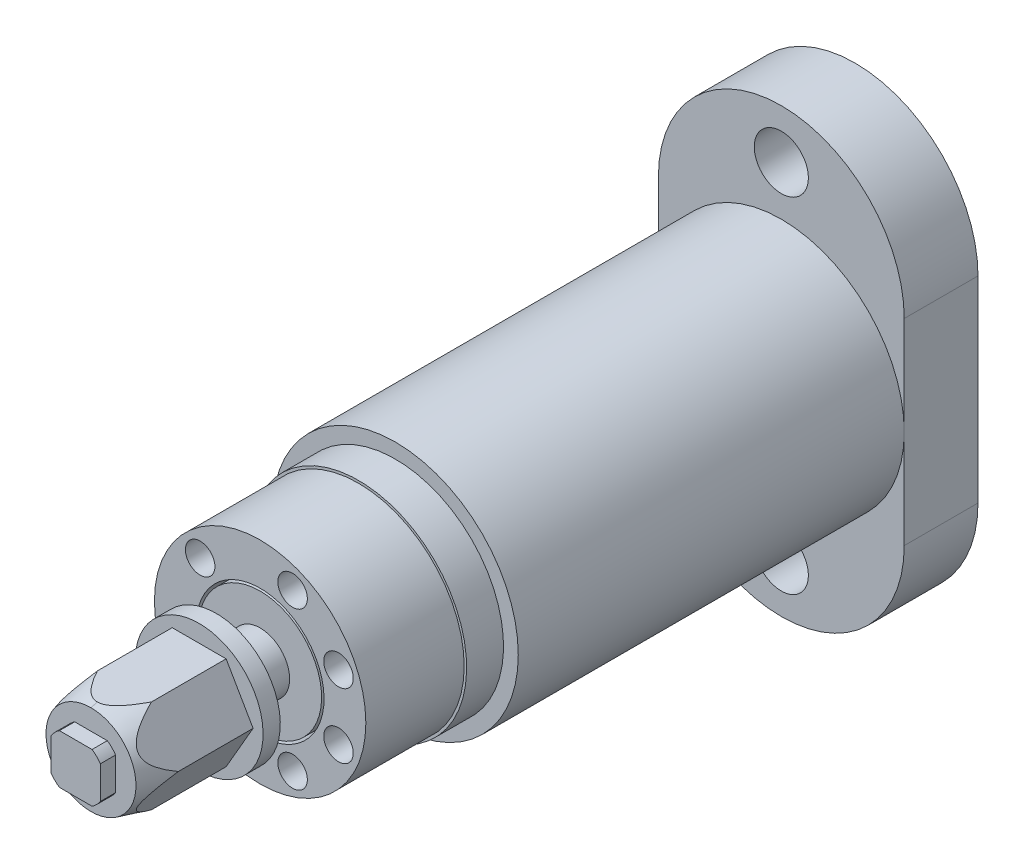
ISO-10303-21;
HEADER;
FILE_DESCRIPTION(('STEP AP214'),'2;1');
FILE_NAME('part.step','',(''),(''),'','','');
FILE_SCHEMA(('AUTOMOTIVE_DESIGN { 1 0 10303 214 1 1 1 1 }'));
ENDSEC;
DATA;
#1=APPLICATION_CONTEXT('core data for automotive mechanical design processes');
#2=APPLICATION_PROTOCOL_DEFINITION('international standard','automotive_design',2000,#1);
#3=PRODUCT_CONTEXT('',#1,'mechanical');
#4=PRODUCT('Part','Part','',(#3));
#5=PRODUCT_RELATED_PRODUCT_CATEGORY('part','',(#4));
#6=PRODUCT_DEFINITION_FORMATION('','',#4);
#7=PRODUCT_DEFINITION_CONTEXT('part definition',#1,'design');
#8=PRODUCT_DEFINITION('design','',#6,#7);
#9=PRODUCT_DEFINITION_SHAPE('','',#8);
#10=(LENGTH_UNIT() NAMED_UNIT(*) SI_UNIT(.MILLI.,.METRE.));
#11=(NAMED_UNIT(*) PLANE_ANGLE_UNIT() SI_UNIT($,.RADIAN.));
#12=(NAMED_UNIT(*) SI_UNIT($,.STERADIAN.) SOLID_ANGLE_UNIT());
#13=UNCERTAINTY_MEASURE_WITH_UNIT(LENGTH_MEASURE(1.E-05),#10,'distance_accuracy_value','');
#14=(GEOMETRIC_REPRESENTATION_CONTEXT(3) GLOBAL_UNCERTAINTY_ASSIGNED_CONTEXT((#13)) GLOBAL_UNIT_ASSIGNED_CONTEXT((#10,
#11,#12)) REPRESENTATION_CONTEXT('',''));
#15=CARTESIAN_POINT('',(0.,0.,0.));
#16=DIRECTION('',(0.,0.,1.));
#17=DIRECTION('',(1.,0.,0.));
#18=AXIS2_PLACEMENT_3D('',#15,#16,#17);
#19=CARTESIAN_POINT('',(0.,0.,59.));
#20=DIRECTION('',(0.,0.,-1.));
#21=DIRECTION('',(0.,1.,0.));
#22=AXIS2_PLACEMENT_3D('',#19,#20,#21);
#23=CYLINDRICAL_SURFACE('',#22,10.5);
#24=CARTESIAN_POINT('',(0.,0.,0.));
#25=DIRECTION('',(0.,0.,-1.));
#26=DIRECTION('',(0.,1.,0.));
#27=AXIS2_PLACEMENT_3D('',#24,#25,#26);
#28=CIRCLE('',#27,10.5);
#29=CARTESIAN_POINT('',(0.,10.5,0.));
#30=VERTEX_POINT('',#29);
#31=EDGE_CURVE('E627',#30,#30,#28,.T.);
#32=ORIENTED_EDGE('',*,*,#31,.T.);
#33=EDGE_LOOP('',(#32));
#34=FACE_BOUND('',#33,.T.);
#35=CARTESIAN_POINT('',(0.,0.,13.95));
#36=DIRECTION('',(0.,0.,1.));
#37=DIRECTION('',(1.,0.,0.));
#38=AXIS2_PLACEMENT_3D('',#35,#36,#37);
#39=CIRCLE('',#38,10.5);
#40=CARTESIAN_POINT('',(10.5,0.,13.95));
#41=VERTEX_POINT('',#40);
#42=EDGE_CURVE('E1179',#41,#41,#39,.T.);
#43=ORIENTED_EDGE('',*,*,#42,.T.);
#44=EDGE_LOOP('',(#43));
#45=FACE_BOUND('',#44,.T.);
#46=ADVANCED_FACE('F14',(#34,#45),#23,.F.);
#47=CARTESIAN_POINT('',(25.3,25.3,93.5));
#48=DIRECTION('',(0.,0.,1.));
#49=DIRECTION('',(-1.,0.,0.));
#50=AXIS2_PLACEMENT_3D('',#47,#48,#49);
#51=PLANE('',#50);
#52=CARTESIAN_POINT('',(0.,0.,93.5));
#53=DIRECTION('',(0.,0.,-1.));
#54=DIRECTION('',(-1.,0.,0.));
#55=AXIS2_PLACEMENT_3D('',#52,#53,#54);
#56=CIRCLE('',#55,22.);
#57=CARTESIAN_POINT('',(-22.,0.,93.5));
#58=VERTEX_POINT('',#57);
#59=EDGE_CURVE('E214',#58,#58,#56,.T.);
#60=ORIENTED_EDGE('',*,*,#59,.T.);
#61=EDGE_LOOP('',(#60));
#62=FACE_BOUND('',#61,.T.);
#63=CARTESIAN_POINT('',(0.,0.,93.5));
#64=DIRECTION('',(0.,0.,-1.));
#65=DIRECTION('',(-1.,0.,0.));
#66=AXIS2_PLACEMENT_3D('',#63,#64,#65);
#67=CIRCLE('',#66,25.);
#68=CARTESIAN_POINT('',(-25.,0.,93.5));
#69=VERTEX_POINT('',#68);
#70=EDGE_CURVE('E653',#69,#69,#67,.F.);
#71=ORIENTED_EDGE('',*,*,#70,.T.);
#72=EDGE_LOOP('',(#71));
#73=FACE_BOUND('',#72,.T.);
#74=ADVANCED_FACE('F369',(#62,#73),#51,.T.);
#75=CARTESIAN_POINT('',(0.,0.,93.5));
#76=DIRECTION('',(0.,0.,-1.));
#77=DIRECTION('',(-1.,0.,0.));
#78=AXIS2_PLACEMENT_3D('',#75,#76,#77);
#79=CYLINDRICAL_SURFACE('',#78,25.);
#80=ORIENTED_EDGE('',*,*,#70,.F.);
#81=EDGE_LOOP('',(#80));
#82=FACE_BOUND('',#81,.T.);
#83=CARTESIAN_POINT('',(0.,0.,15.));
#84=DIRECTION('',(0.,0.,-1.));
#85=DIRECTION('',(-1.,0.,0.));
#86=AXIS2_PLACEMENT_3D('',#83,#84,#85);
#87=CIRCLE('',#86,25.);
#88=CARTESIAN_POINT('',(-25.,-2.24485013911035E-09,15.));
#89=VERTEX_POINT('',#88);
#90=CARTESIAN_POINT('',(25.,-5.12759973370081E-09,15.));
#91=VERTEX_POINT('',#90);
#92=EDGE_CURVE('E651',#89,#91,#87,.T.);
#93=ORIENTED_EDGE('',*,*,#92,.F.);
#94=CARTESIAN_POINT('',(0.,0.,15.));
#95=DIRECTION('',(0.,0.,-1.));
#96=DIRECTION('',(-1.,0.,0.));
#97=AXIS2_PLACEMENT_3D('',#94,#95,#96);
#98=CIRCLE('',#97,25.);
#99=EDGE_CURVE('E620',#91,#89,#98,.T.);
#100=ORIENTED_EDGE('',*,*,#99,.F.);
#101=EDGE_LOOP('',(#93,#100));
#102=FACE_BOUND('',#101,.T.);
#103=ADVANCED_FACE('F375',(#82,#102),#79,.T.);
#104=CARTESIAN_POINT('',(-25.,-0.270000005,15.));
#105=DIRECTION('',(0.,0.,1.));
#106=DIRECTION('',(1.,0.,0.));
#107=AXIS2_PLACEMENT_3D('',#104,#105,#106);
#108=PLANE('',#107);
#109=CARTESIAN_POINT('',(0.,35.,15.));
#110=DIRECTION('',(0.,0.,1.));
#111=DIRECTION('',(1.,0.,0.));
#112=AXIS2_PLACEMENT_3D('',#109,#110,#111);
#113=CIRCLE('',#112,5.5);
#114=CARTESIAN_POINT('',(5.5,35.,15.));
#115=VERTEX_POINT('',#114);
#116=EDGE_CURVE('E643',#115,#115,#113,.T.);
#117=ORIENTED_EDGE('',*,*,#116,.F.);
#118=EDGE_LOOP('',(#117));
#119=FACE_BOUND('',#118,.T.);
#120=DIRECTION('',(0.,-1.,0.));
#121=VECTOR('',#120,1.);
#122=CARTESIAN_POINT('',(25.,-9.9999869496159E-10,15.));
#123=LINE('',#122,#121);
#124=CARTESIAN_POINT('',(25.,19.9999999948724,15.));
#125=VERTEX_POINT('',#124);
#126=EDGE_CURVE('E617',#125,#91,#123,.T.);
#127=ORIENTED_EDGE('',*,*,#126,.F.);
#128=CARTESIAN_POINT('',(0.,20.,15.));
#129=DIRECTION('',(0.,0.,-1.));
#130=DIRECTION('',(0.,1.,0.));
#131=AXIS2_PLACEMENT_3D('',#128,#129,#130);
#132=CIRCLE('',#131,25.);
#133=CARTESIAN_POINT('',(-25.,20.,15.));
#134=VERTEX_POINT('',#133);
#135=EDGE_CURVE('E611',#125,#134,#132,.F.);
#136=ORIENTED_EDGE('',*,*,#135,.T.);
#137=DIRECTION('',(0.,1.,0.));
#138=VECTOR('',#137,1.);
#139=CARTESIAN_POINT('',(-25.,-2.50000020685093E-09,15.));
#140=LINE('',#139,#138);
#141=EDGE_CURVE('E607',#89,#134,#140,.T.);
#142=ORIENTED_EDGE('',*,*,#141,.F.);
#143=ORIENTED_EDGE('',*,*,#92,.T.);
#144=EDGE_LOOP('',(#127,#136,#142,#143));
#145=FACE_BOUND('',#144,.T.);
#146=ADVANCED_FACE('F398',(#119,#145),#108,.T.);
#147=CARTESIAN_POINT('',(-25.,-45.27,15.));
#148=DIRECTION('',(0.,0.,1.));
#149=DIRECTION('',(1.,0.,0.));
#150=AXIS2_PLACEMENT_3D('',#147,#148,#149);
#151=PLANE('',#150);
#152=CARTESIAN_POINT('',(0.,-35.,15.));
#153=DIRECTION('',(0.,0.,1.));
#154=DIRECTION('',(1.,0.,0.));
#155=AXIS2_PLACEMENT_3D('',#152,#153,#154);
#156=CIRCLE('',#155,5.5);
#157=CARTESIAN_POINT('',(5.5,-35.,15.));
#158=VERTEX_POINT('',#157);
#159=EDGE_CURVE('E599',#158,#158,#156,.T.);
#160=ORIENTED_EDGE('',*,*,#159,.F.);
#161=EDGE_LOOP('',(#160));
#162=FACE_BOUND('',#161,.T.);
#163=DIRECTION('',(0.,1.,0.));
#164=VECTOR('',#163,1.);
#165=CARTESIAN_POINT('',(-25.,-2.50000020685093E-09,15.));
#166=LINE('',#165,#164);
#167=CARTESIAN_POINT('',(-25.,-20.0000000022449,15.));
#168=VERTEX_POINT('',#167);
#169=EDGE_CURVE('E613',#168,#89,#166,.T.);
#170=ORIENTED_EDGE('',*,*,#169,.F.);
#171=CARTESIAN_POINT('',(0.,-20.,15.));
#172=DIRECTION('',(0.,0.,-1.));
#173=DIRECTION('',(0.,1.,0.));
#174=AXIS2_PLACEMENT_3D('',#171,#172,#173);
#175=CIRCLE('',#174,25.);
#176=CARTESIAN_POINT('',(25.,-20.0000000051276,15.));
#177=VERTEX_POINT('',#176);
#178=EDGE_CURVE('E605',#168,#177,#175,.F.);
#179=ORIENTED_EDGE('',*,*,#178,.T.);
#180=DIRECTION('',(0.,-1.,0.));
#181=VECTOR('',#180,1.);
#182=CARTESIAN_POINT('',(25.,-9.9999869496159E-10,15.));
#183=LINE('',#182,#181);
#184=EDGE_CURVE('E612',#91,#177,#183,.T.);
#185=ORIENTED_EDGE('',*,*,#184,.F.);
#186=ORIENTED_EDGE('',*,*,#99,.T.);
#187=EDGE_LOOP('',(#170,#179,#185,#186));
#188=FACE_BOUND('',#187,.T.);
#189=ADVANCED_FACE('F401',(#162,#188),#151,.T.);
#190=CARTESIAN_POINT('',(0.,35.,0.));
#191=DIRECTION('',(0.,0.,1.));
#192=DIRECTION('',(1.,0.,0.));
#193=AXIS2_PLACEMENT_3D('',#190,#191,#192);
#194=CYLINDRICAL_SURFACE('',#193,5.5);
#195=ORIENTED_EDGE('',*,*,#116,.T.);
#196=EDGE_LOOP('',(#195));
#197=FACE_BOUND('',#196,.T.);
#198=CARTESIAN_POINT('',(0.,35.,0.));
#199=DIRECTION('',(0.,0.,1.));
#200=DIRECTION('',(1.,0.,0.));
#201=AXIS2_PLACEMENT_3D('',#198,#199,#200);
#202=CIRCLE('',#201,5.5);
#203=CARTESIAN_POINT('',(5.5,35.,0.));
#204=VERTEX_POINT('',#203);
#205=EDGE_CURVE('E635',#204,#204,#202,.F.);
#206=ORIENTED_EDGE('',*,*,#205,.T.);
#207=EDGE_LOOP('',(#206));
#208=FACE_BOUND('',#207,.T.);
#209=ADVANCED_FACE('F405',(#197,#208),#194,.F.);
#210=CARTESIAN_POINT('',(25.,-20.,0.));
#211=DIRECTION('',(1.,0.,0.));
#212=DIRECTION('',(0.,1.,0.));
#213=AXIS2_PLACEMENT_3D('',#210,#211,#212);
#214=PLANE('',#213);
#215=DIRECTION('',(0.,0.,1.));
#216=VECTOR('',#215,1.);
#217=CARTESIAN_POINT('',(25.,-20.0000000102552,7.5));
#218=LINE('',#217,#216);
#219=CARTESIAN_POINT('',(25.,-20.0000000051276,0.));
#220=VERTEX_POINT('',#219);
#221=EDGE_CURVE('E600',#177,#220,#218,.F.);
#222=ORIENTED_EDGE('',*,*,#221,.T.);
#223=DIRECTION('',(0.,1.,0.));
#224=VECTOR('',#223,1.);
#225=CARTESIAN_POINT('',(25.,0.,0.));
#226=LINE('',#225,#224);
#227=CARTESIAN_POINT('',(25.,19.9999999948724,0.));
#228=VERTEX_POINT('',#227);
#229=EDGE_CURVE('E596',#220,#228,#226,.T.);
#230=ORIENTED_EDGE('',*,*,#229,.T.);
#231=DIRECTION('',(0.,0.,-1.));
#232=VECTOR('',#231,1.);
#233=CARTESIAN_POINT('',(25.,19.9999999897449,7.5));
#234=LINE('',#233,#232);
#235=EDGE_CURVE('E608',#228,#125,#234,.F.);
#236=ORIENTED_EDGE('',*,*,#235,.T.);
#237=ORIENTED_EDGE('',*,*,#126,.T.);
#238=ORIENTED_EDGE('',*,*,#184,.T.);
#239=EDGE_LOOP('',(#222,#230,#236,#237,#238));
#240=FACE_BOUND('',#239,.T.);
#241=ADVANCED_FACE('F407',(#240),#214,.T.);
#242=CARTESIAN_POINT('',(0.,20.,15.));
#243=DIRECTION('',(0.,0.,-1.));
#244=DIRECTION('',(0.,1.,0.));
#245=AXIS2_PLACEMENT_3D('',#242,#243,#244);
#246=CYLINDRICAL_SURFACE('',#245,25.);
#247=ORIENTED_EDGE('',*,*,#235,.F.);
#248=CARTESIAN_POINT('',(0.,20.,0.));
#249=DIRECTION('',(0.,0.,-1.));
#250=DIRECTION('',(0.,1.,0.));
#251=AXIS2_PLACEMENT_3D('',#248,#249,#250);
#252=CIRCLE('',#251,25.);
#253=CARTESIAN_POINT('',(-25.,20.,0.));
#254=VERTEX_POINT('',#253);
#255=EDGE_CURVE('E595',#228,#254,#252,.F.);
#256=ORIENTED_EDGE('',*,*,#255,.T.);
#257=DIRECTION('',(0.,0.,-1.));
#258=VECTOR('',#257,1.);
#259=CARTESIAN_POINT('',(-25.,20.,7.5));
#260=LINE('',#259,#258);
#261=EDGE_CURVE('E603',#134,#254,#260,.T.);
#262=ORIENTED_EDGE('',*,*,#261,.F.);
#263=ORIENTED_EDGE('',*,*,#135,.F.);
#264=EDGE_LOOP('',(#247,#256,#262,#263));
#265=FACE_BOUND('',#264,.T.);
#266=ADVANCED_FACE('F410',(#265),#246,.T.);
#267=CARTESIAN_POINT('',(-25.,20.,0.));
#268=DIRECTION('',(-1.,0.,0.));
#269=DIRECTION('',(0.,-1.,0.));
#270=AXIS2_PLACEMENT_3D('',#267,#268,#269);
#271=PLANE('',#270);
#272=ORIENTED_EDGE('',*,*,#261,.T.);
#273=DIRECTION('',(0.,-1.,0.));
#274=VECTOR('',#273,1.);
#275=CARTESIAN_POINT('',(-25.,0.,0.));
#276=LINE('',#275,#274);
#277=CARTESIAN_POINT('',(-25.,-20.0000000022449,0.));
#278=VERTEX_POINT('',#277);
#279=EDGE_CURVE('E591',#254,#278,#276,.T.);
#280=ORIENTED_EDGE('',*,*,#279,.T.);
#281=DIRECTION('',(0.,0.,-1.));
#282=VECTOR('',#281,1.);
#283=CARTESIAN_POINT('',(-25.,-20.0000000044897,7.5));
#284=LINE('',#283,#282);
#285=EDGE_CURVE('E33',#278,#168,#284,.F.);
#286=ORIENTED_EDGE('',*,*,#285,.T.);
#287=ORIENTED_EDGE('',*,*,#169,.T.);
#288=ORIENTED_EDGE('',*,*,#141,.T.);
#289=EDGE_LOOP('',(#272,#280,#286,#287,#288));
#290=FACE_BOUND('',#289,.T.);
#291=ADVANCED_FACE('F412',(#290),#271,.T.);
#292=CARTESIAN_POINT('',(0.,-35.,0.));
#293=DIRECTION('',(0.,0.,1.));
#294=DIRECTION('',(1.,0.,0.));
#295=AXIS2_PLACEMENT_3D('',#292,#293,#294);
#296=CYLINDRICAL_SURFACE('',#295,5.5);
#297=ORIENTED_EDGE('',*,*,#159,.T.);
#298=EDGE_LOOP('',(#297));
#299=FACE_BOUND('',#298,.T.);
#300=CARTESIAN_POINT('',(0.,-35.,0.));
#301=DIRECTION('',(0.,0.,1.));
#302=DIRECTION('',(1.,0.,0.));
#303=AXIS2_PLACEMENT_3D('',#300,#301,#302);
#304=CIRCLE('',#303,5.5);
#305=CARTESIAN_POINT('',(5.5,-35.,0.));
#306=VERTEX_POINT('',#305);
#307=EDGE_CURVE('E632',#306,#306,#304,.F.);
#308=ORIENTED_EDGE('',*,*,#307,.T.);
#309=EDGE_LOOP('',(#308));
#310=FACE_BOUND('',#309,.T.);
#311=ADVANCED_FACE('F415',(#299,#310),#296,.F.);
#312=CARTESIAN_POINT('',(0.,-20.,15.));
#313=DIRECTION('',(0.,0.,-1.));
#314=DIRECTION('',(0.,1.,0.));
#315=AXIS2_PLACEMENT_3D('',#312,#313,#314);
#316=CYLINDRICAL_SURFACE('',#315,25.);
#317=ORIENTED_EDGE('',*,*,#285,.F.);
#318=CARTESIAN_POINT('',(0.,-20.,0.));
#319=DIRECTION('',(0.,0.,-1.));
#320=DIRECTION('',(0.,1.,0.));
#321=AXIS2_PLACEMENT_3D('',#318,#319,#320);
#322=CIRCLE('',#321,25.);
#323=EDGE_CURVE('E594',#278,#220,#322,.F.);
#324=ORIENTED_EDGE('',*,*,#323,.T.);
#325=ORIENTED_EDGE('',*,*,#221,.F.);
#326=ORIENTED_EDGE('',*,*,#178,.F.);
#327=EDGE_LOOP('',(#317,#324,#325,#326));
#328=FACE_BOUND('',#327,.T.);
#329=ADVANCED_FACE('F420',(#328),#316,.T.);
#330=CARTESIAN_POINT('',(-25.,-45.54,0.));
#331=DIRECTION('',(0.,0.,1.));
#332=DIRECTION('',(1.,0.,0.));
#333=AXIS2_PLACEMENT_3D('',#330,#331,#332);
#334=PLANE('',#333);
#335=CARTESIAN_POINT('',(0.,0.,0.));
#336=DIRECTION('',(0.,0.,-1.));
#337=DIRECTION('',(-1.,0.,0.));
#338=AXIS2_PLACEMENT_3D('',#335,#336,#337);
#339=CIRCLE('',#338,13.);
#340=CARTESIAN_POINT('',(-13.,0.,0.));
#341=VERTEX_POINT('',#340);
#342=EDGE_CURVE('E629',#341,#341,#339,.F.);
#343=ORIENTED_EDGE('',*,*,#342,.T.);
#344=EDGE_LOOP('',(#343));
#345=FACE_BOUND('',#344,.T.);
#346=ORIENTED_EDGE('',*,*,#307,.F.);
#347=EDGE_LOOP('',(#346));
#348=FACE_BOUND('',#347,.T.);
#349=ORIENTED_EDGE('',*,*,#205,.F.);
#350=EDGE_LOOP('',(#349));
#351=FACE_BOUND('',#350,.T.);
#352=ORIENTED_EDGE('',*,*,#279,.F.);
#353=ORIENTED_EDGE('',*,*,#255,.F.);
#354=ORIENTED_EDGE('',*,*,#229,.F.);
#355=ORIENTED_EDGE('',*,*,#323,.F.);
#356=EDGE_LOOP('',(#352,#353,#354,#355));
#357=FACE_BOUND('',#356,.T.);
#358=ADVANCED_FACE('F417',(#345,#348,#351,#357),#334,.F.);
#359=CARTESIAN_POINT('',(-11.132,-11.132,0.));
#360=DIRECTION('',(0.,0.,1.));
#361=DIRECTION('',(1.,0.,0.));
#362=AXIS2_PLACEMENT_3D('',#359,#360,#361);
#363=PLANE('',#362);
#364=ORIENTED_EDGE('',*,*,#31,.F.);
#365=EDGE_LOOP('',(#364));
#366=FACE_BOUND('',#365,.T.);
#367=CARTESIAN_POINT('',(0.,0.,0.));
#368=DIRECTION('',(0.,0.,-1.));
#369=DIRECTION('',(-1.,0.,0.));
#370=AXIS2_PLACEMENT_3D('',#367,#368,#369);
#371=CIRCLE('',#370,11.);
#372=CARTESIAN_POINT('',(-11.,0.,0.));
#373=VERTEX_POINT('',#372);
#374=EDGE_CURVE('E24',#373,#373,#371,.F.);
#375=ORIENTED_EDGE('',*,*,#374,.F.);
#376=EDGE_LOOP('',(#375));
#377=FACE_BOUND('',#376,.T.);
#378=ADVANCED_FACE('F395',(#366,#377),#363,.F.);
#379=CARTESIAN_POINT('',(0.,0.,0.));
#380=DIRECTION('',(0.,0.,-1.));
#381=DIRECTION('',(-1.,0.,0.));
#382=AXIS2_PLACEMENT_3D('',#379,#380,#381);
#383=CYLINDRICAL_SURFACE('',#382,11.);
#384=CARTESIAN_POINT('',(0.,0.,-10.));
#385=DIRECTION('',(0.,0.,-1.));
#386=DIRECTION('',(-1.,0.,0.));
#387=AXIS2_PLACEMENT_3D('',#384,#385,#386);
#388=CIRCLE('',#387,11.);
#389=CARTESIAN_POINT('',(-11.,0.,-10.));
#390=VERTEX_POINT('',#389);
#391=EDGE_CURVE('E9',#390,#390,#388,.T.);
#392=ORIENTED_EDGE('',*,*,#391,.T.);
#393=EDGE_LOOP('',(#392));
#394=FACE_BOUND('',#393,.T.);
#395=ORIENTED_EDGE('',*,*,#374,.T.);
#396=EDGE_LOOP('',(#395));
#397=FACE_BOUND('',#396,.T.);
#398=ADVANCED_FACE('F388',(#394,#397),#383,.F.);
#399=CARTESIAN_POINT('',(-14.292707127,-11.911305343,-10.));
#400=DIRECTION('',(0.,0.,1.));
#401=DIRECTION('',(0.995895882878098,-0.0905063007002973,0.));
#402=AXIS2_PLACEMENT_3D('',#399,#400,#401);
#403=PLANE('',#402);
#404=ORIENTED_EDGE('',*,*,#391,.F.);
#405=EDGE_LOOP('',(#404));
#406=FACE_BOUND('',#405,.T.);
#407=CARTESIAN_POINT('',(0.,0.,-10.));
#408=DIRECTION('',(0.,0.,-1.));
#409=DIRECTION('',(-1.,0.,0.));
#410=AXIS2_PLACEMENT_3D('',#407,#408,#409);
#411=CIRCLE('',#410,13.);
#412=CARTESIAN_POINT('',(-13.,0.,-10.));
#413=VERTEX_POINT('',#412);
#414=EDGE_CURVE('E624',#413,#413,#411,.F.);
#415=ORIENTED_EDGE('',*,*,#414,.F.);
#416=EDGE_LOOP('',(#415));
#417=FACE_BOUND('',#416,.T.);
#418=ADVANCED_FACE('F383',(#406,#417),#403,.F.);
#419=CARTESIAN_POINT('',(0.,0.,0.));
#420=DIRECTION('',(0.,0.,-1.));
#421=DIRECTION('',(-1.,0.,0.));
#422=AXIS2_PLACEMENT_3D('',#419,#420,#421);
#423=CYLINDRICAL_SURFACE('',#422,13.);
#424=ORIENTED_EDGE('',*,*,#342,.F.);
#425=EDGE_LOOP('',(#424));
#426=FACE_BOUND('',#425,.T.);
#427=ORIENTED_EDGE('',*,*,#414,.T.);
#428=EDGE_LOOP('',(#427));
#429=FACE_BOUND('',#428,.T.);
#430=ADVANCED_FACE('F320',(#426,#429),#423,.T.);
#431=CARTESIAN_POINT('',(0.,0.,30.));
#432=DIRECTION('',(0.,0.,1.));
#433=DIRECTION('',(0.,-1.,0.));
#434=AXIS2_PLACEMENT_3D('',#431,#432,#433);
#435=CYLINDRICAL_SURFACE('',#434,22.);
#436=ORIENTED_EDGE('',*,*,#59,.F.);
#437=EDGE_LOOP('',(#436));
#438=FACE_BOUND('',#437,.T.);
#439=CARTESIAN_POINT('',(0.,0.,101.));
#440=DIRECTION('',(0.,0.,1.));
#441=DIRECTION('',(0.,-1.,0.));
#442=AXIS2_PLACEMENT_3D('',#439,#440,#441);
#443=CIRCLE('',#442,22.);
#444=CARTESIAN_POINT('',(0.,-22.,101.));
#445=VERTEX_POINT('',#444);
#446=EDGE_CURVE('E18',#445,#445,#443,.F.);
#447=ORIENTED_EDGE('',*,*,#446,.T.);
#448=EDGE_LOOP('',(#447));
#449=FACE_BOUND('',#448,.T.);
#450=ADVANCED_FACE('F316',(#438,#449),#435,.T.);
#451=CARTESIAN_POINT('',(-22.264,-22.264,101.));
#452=DIRECTION('',(0.,0.,-1.));
#453=DIRECTION('',(0.,1.,0.));
#454=AXIS2_PLACEMENT_3D('',#451,#452,#453);
#455=PLANE('',#454);
#456=CARTESIAN_POINT('',(0.,0.,101.));
#457=DIRECTION('',(0.,0.,1.));
#458=DIRECTION('',(-1.,0.,0.));
#459=AXIS2_PLACEMENT_3D('',#456,#457,#458);
#460=CIRCLE('',#459,21.5);
#461=CARTESIAN_POINT('',(-21.5,0.,101.));
#462=VERTEX_POINT('',#461);
#463=EDGE_CURVE('E574',#462,#462,#460,.F.);
#464=ORIENTED_EDGE('',*,*,#463,.T.);
#465=EDGE_LOOP('',(#464));
#466=FACE_BOUND('',#465,.T.);
#467=ORIENTED_EDGE('',*,*,#446,.F.);
#468=EDGE_LOOP('',(#467));
#469=FACE_BOUND('',#468,.T.);
#470=ADVANCED_FACE('F319',(#466,#469),#455,.F.);
#471=CARTESIAN_POINT('',(0.,0.,101.));
#472=DIRECTION('',(0.,0.,1.));
#473=DIRECTION('',(-1.,0.,0.));
#474=AXIS2_PLACEMENT_3D('',#471,#472,#473);
#475=CYLINDRICAL_SURFACE('',#474,21.5);
#476=ORIENTED_EDGE('',*,*,#463,.F.);
#477=EDGE_LOOP('',(#476));
#478=FACE_BOUND('',#477,.T.);
#479=CARTESIAN_POINT('',(0.,0.,121.));
#480=DIRECTION('',(0.,0.,1.));
#481=DIRECTION('',(-1.,0.,0.));
#482=AXIS2_PLACEMENT_3D('',#479,#480,#481);
#483=CIRCLE('',#482,21.5);
#484=CARTESIAN_POINT('',(-21.5,0.,121.));
#485=VERTEX_POINT('',#484);
#486=EDGE_CURVE('E569',#485,#485,#483,.F.);
#487=ORIENTED_EDGE('',*,*,#486,.T.);
#488=EDGE_LOOP('',(#487));
#489=FACE_BOUND('',#488,.T.);
#490=ADVANCED_FACE('F322',(#478,#489),#475,.T.);
#491=CARTESIAN_POINT('',(-21.758,-21.758,121.));
#492=DIRECTION('',(0.,0.,-1.));
#493=DIRECTION('',(0.,1.,0.));
#494=AXIS2_PLACEMENT_3D('',#491,#492,#493);
#495=PLANE('',#494);
#496=CARTESIAN_POINT('',(0.,0.,121.));
#497=DIRECTION('',(0.,0.,1.));
#498=DIRECTION('',(0.,-1.,0.));
#499=AXIS2_PLACEMENT_3D('',#496,#497,#498);
#500=CIRCLE('',#499,13.);
#501=CARTESIAN_POINT('',(0.,-13.,121.));
#502=VERTEX_POINT('',#501);
#503=EDGE_CURVE('E551',#502,#502,#500,.T.);
#504=ORIENTED_EDGE('',*,*,#503,.F.);
#505=EDGE_LOOP('',(#504));
#506=FACE_BOUND('',#505,.T.);
#507=CARTESIAN_POINT('',(-12.197591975,-12.197591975,121.));
#508=DIRECTION('',(0.,0.,1.));
#509=DIRECTION('',(0.,-1.,0.));
#510=AXIS2_PLACEMENT_3D('',#507,#508,#509);
#511=CIRCLE('',#510,3.);
#512=CARTESIAN_POINT('',(-12.197591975,-15.197591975,121.));
#513=VERTEX_POINT('',#512);
#514=EDGE_CURVE('E554',#513,#513,#511,.T.);
#515=ORIENTED_EDGE('',*,*,#514,.F.);
#516=EDGE_LOOP('',(#515));
#517=FACE_BOUND('',#516,.T.);
#518=CARTESIAN_POINT('',(6.601289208,-15.936921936,121.));
#519=DIRECTION('',(0.,0.,1.));
#520=DIRECTION('',(0.,-1.,0.));
#521=AXIS2_PLACEMENT_3D('',#518,#519,#520);
#522=CIRCLE('',#521,3.);
#523=CARTESIAN_POINT('',(6.601289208,-18.936921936,121.));
#524=VERTEX_POINT('',#523);
#525=EDGE_CURVE('E557',#524,#524,#522,.T.);
#526=ORIENTED_EDGE('',*,*,#525,.F.);
#527=EDGE_LOOP('',(#526));
#528=FACE_BOUND('',#527,.T.);
#529=CARTESIAN_POINT('',(15.936921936,-6.601289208,121.));
#530=DIRECTION('',(0.,0.,1.));
#531=DIRECTION('',(0.,-1.,0.));
#532=AXIS2_PLACEMENT_3D('',#529,#530,#531);
#533=CIRCLE('',#532,3.);
#534=CARTESIAN_POINT('',(15.936921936,-9.601289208,121.));
#535=VERTEX_POINT('',#534);
#536=EDGE_CURVE('E560',#535,#535,#533,.T.);
#537=ORIENTED_EDGE('',*,*,#536,.F.);
#538=EDGE_LOOP('',(#537));
#539=FACE_BOUND('',#538,.T.);
#540=CARTESIAN_POINT('',(-12.197591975,12.197591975,121.));
#541=DIRECTION('',(0.,0.,1.));
#542=DIRECTION('',(0.,-1.,0.));
#543=AXIS2_PLACEMENT_3D('',#540,#541,#542);
#544=CIRCLE('',#543,3.);
#545=CARTESIAN_POINT('',(-12.197591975,9.197591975,121.));
#546=VERTEX_POINT('',#545);
#547=EDGE_CURVE('E563',#546,#546,#544,.T.);
#548=ORIENTED_EDGE('',*,*,#547,.F.);
#549=EDGE_LOOP('',(#548));
#550=FACE_BOUND('',#549,.T.);
#551=CARTESIAN_POINT('',(6.601289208,15.936921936,121.));
#552=DIRECTION('',(0.,0.,1.));
#553=DIRECTION('',(0.,-1.,0.));
#554=AXIS2_PLACEMENT_3D('',#551,#552,#553);
#555=CIRCLE('',#554,3.);
#556=CARTESIAN_POINT('',(6.601289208,12.936921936,121.));
#557=VERTEX_POINT('',#556);
#558=EDGE_CURVE('E566',#557,#557,#555,.T.);
#559=ORIENTED_EDGE('',*,*,#558,.F.);
#560=EDGE_LOOP('',(#559));
#561=FACE_BOUND('',#560,.T.);
#562=CARTESIAN_POINT('',(15.936921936,6.601289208,121.));
#563=DIRECTION('',(0.,0.,1.));
#564=DIRECTION('',(0.,-1.,0.));
#565=AXIS2_PLACEMENT_3D('',#562,#563,#564);
#566=CIRCLE('',#565,3.);
#567=CARTESIAN_POINT('',(15.936921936,3.601289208,121.));
#568=VERTEX_POINT('',#567);
#569=EDGE_CURVE('E548',#568,#568,#566,.T.);
#570=ORIENTED_EDGE('',*,*,#569,.F.);
#571=EDGE_LOOP('',(#570));
#572=FACE_BOUND('',#571,.T.);
#573=ORIENTED_EDGE('',*,*,#486,.F.);
#574=EDGE_LOOP('',(#573));
#575=FACE_BOUND('',#574,.T.);
#576=ADVANCED_FACE('F16',(#506,#517,#528,#539,#550,#561,#572,#575),#495,.F.);
#577=CARTESIAN_POINT('',(0.,0.,112.));
#578=DIRECTION('',(0.,0.,1.));
#579=DIRECTION('',(0.,-1.,0.));
#580=AXIS2_PLACEMENT_3D('',#577,#578,#579);
#581=CYLINDRICAL_SURFACE('',#580,13.);
#582=CARTESIAN_POINT('',(0.,0.,112.));
#583=DIRECTION('',(0.,0.,1.));
#584=DIRECTION('',(0.,-1.,0.));
#585=AXIS2_PLACEMENT_3D('',#582,#583,#584);
#586=CIRCLE('',#585,13.);
#587=CARTESIAN_POINT('',(0.,-13.,112.));
#588=VERTEX_POINT('',#587);
#589=EDGE_CURVE('E572',#588,#588,#586,.F.);
#590=ORIENTED_EDGE('',*,*,#589,.T.);
#591=EDGE_LOOP('',(#590));
#592=FACE_BOUND('',#591,.T.);
#593=ORIENTED_EDGE('',*,*,#503,.T.);
#594=EDGE_LOOP('',(#593));
#595=FACE_BOUND('',#594,.T.);
#596=ADVANCED_FACE('F347',(#592,#595),#581,.F.);
#597=CARTESIAN_POINT('',(-12.197591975,-12.197591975,109.));
#598=DIRECTION('',(0.,0.,1.));
#599=DIRECTION('',(0.,-1.,0.));
#600=AXIS2_PLACEMENT_3D('',#597,#598,#599);
#601=CYLINDRICAL_SURFACE('',#600,3.);
#602=CARTESIAN_POINT('',(-12.197591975,-12.197591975,109.));
#603=DIRECTION('',(0.,0.,1.));
#604=DIRECTION('',(0.,-1.,0.));
#605=AXIS2_PLACEMENT_3D('',#602,#603,#604);
#606=CIRCLE('',#605,3.);
#607=CARTESIAN_POINT('',(-12.197591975,-15.197591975,109.));
#608=VERTEX_POINT('',#607);
#609=EDGE_CURVE('E1178',#608,#608,#606,.T.);
#610=ORIENTED_EDGE('',*,*,#609,.F.);
#611=EDGE_LOOP('',(#610));
#612=FACE_BOUND('',#611,.T.);
#613=ORIENTED_EDGE('',*,*,#514,.T.);
#614=EDGE_LOOP('',(#613));
#615=FACE_BOUND('',#614,.T.);
#616=ADVANCED_FACE('F343',(#612,#615),#601,.F.);
#617=CARTESIAN_POINT('',(6.601289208,-15.936921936,109.));
#618=DIRECTION('',(0.,0.,1.));
#619=DIRECTION('',(0.,-1.,0.));
#620=AXIS2_PLACEMENT_3D('',#617,#618,#619);
#621=CYLINDRICAL_SURFACE('',#620,3.);
#622=CARTESIAN_POINT('',(6.601289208,-15.936921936,109.));
#623=DIRECTION('',(0.,0.,1.));
#624=DIRECTION('',(0.,-1.,0.));
#625=AXIS2_PLACEMENT_3D('',#622,#623,#624);
#626=CIRCLE('',#625,3.);
#627=CARTESIAN_POINT('',(6.601289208,-18.936921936,109.));
#628=VERTEX_POINT('',#627);
#629=EDGE_CURVE('E1177',#628,#628,#626,.T.);
#630=ORIENTED_EDGE('',*,*,#629,.F.);
#631=EDGE_LOOP('',(#630));
#632=FACE_BOUND('',#631,.T.);
#633=ORIENTED_EDGE('',*,*,#525,.T.);
#634=EDGE_LOOP('',(#633));
#635=FACE_BOUND('',#634,.T.);
#636=ADVANCED_FACE('F339',(#632,#635),#621,.F.);
#637=CARTESIAN_POINT('',(15.936921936,-6.601289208,109.));
#638=DIRECTION('',(0.,0.,1.));
#639=DIRECTION('',(0.,-1.,0.));
#640=AXIS2_PLACEMENT_3D('',#637,#638,#639);
#641=CYLINDRICAL_SURFACE('',#640,3.);
#642=CARTESIAN_POINT('',(15.936921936,-6.601289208,109.));
#643=DIRECTION('',(0.,0.,1.));
#644=DIRECTION('',(0.,-1.,0.));
#645=AXIS2_PLACEMENT_3D('',#642,#643,#644);
#646=CIRCLE('',#645,3.);
#647=CARTESIAN_POINT('',(15.936921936,-9.601289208,109.));
#648=VERTEX_POINT('',#647);
#649=EDGE_CURVE('E578',#648,#648,#646,.T.);
#650=ORIENTED_EDGE('',*,*,#649,.F.);
#651=EDGE_LOOP('',(#650));
#652=FACE_BOUND('',#651,.T.);
#653=ORIENTED_EDGE('',*,*,#536,.T.);
#654=EDGE_LOOP('',(#653));
#655=FACE_BOUND('',#654,.T.);
#656=ADVANCED_FACE('F335',(#652,#655),#641,.F.);
#657=CARTESIAN_POINT('',(-12.197591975,12.197591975,109.));
#658=DIRECTION('',(0.,0.,1.));
#659=DIRECTION('',(0.,-1.,0.));
#660=AXIS2_PLACEMENT_3D('',#657,#658,#659);
#661=CYLINDRICAL_SURFACE('',#660,3.);
#662=CARTESIAN_POINT('',(-12.197591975,12.197591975,109.));
#663=DIRECTION('',(0.,0.,1.));
#664=DIRECTION('',(0.,-1.,0.));
#665=AXIS2_PLACEMENT_3D('',#662,#663,#664);
#666=CIRCLE('',#665,3.);
#667=CARTESIAN_POINT('',(-12.197591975,9.197591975,109.));
#668=VERTEX_POINT('',#667);
#669=EDGE_CURVE('E587',#668,#668,#666,.T.);
#670=ORIENTED_EDGE('',*,*,#669,.F.);
#671=EDGE_LOOP('',(#670));
#672=FACE_BOUND('',#671,.T.);
#673=ORIENTED_EDGE('',*,*,#547,.T.);
#674=EDGE_LOOP('',(#673));
#675=FACE_BOUND('',#674,.T.);
#676=ADVANCED_FACE('F331',(#672,#675),#661,.F.);
#677=CARTESIAN_POINT('',(6.601289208,15.936921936,109.));
#678=DIRECTION('',(0.,0.,1.));
#679=DIRECTION('',(0.,-1.,0.));
#680=AXIS2_PLACEMENT_3D('',#677,#678,#679);
#681=CYLINDRICAL_SURFACE('',#680,3.);
#682=CARTESIAN_POINT('',(6.601289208,15.936921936,109.));
#683=DIRECTION('',(0.,0.,1.));
#684=DIRECTION('',(0.,-1.,0.));
#685=AXIS2_PLACEMENT_3D('',#682,#683,#684);
#686=CIRCLE('',#685,3.);
#687=CARTESIAN_POINT('',(6.601289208,12.936921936,109.));
#688=VERTEX_POINT('',#687);
#689=EDGE_CURVE('E582',#688,#688,#686,.T.);
#690=ORIENTED_EDGE('',*,*,#689,.F.);
#691=EDGE_LOOP('',(#690));
#692=FACE_BOUND('',#691,.T.);
#693=ORIENTED_EDGE('',*,*,#558,.T.);
#694=EDGE_LOOP('',(#693));
#695=FACE_BOUND('',#694,.T.);
#696=ADVANCED_FACE('F326',(#692,#695),#681,.F.);
#697=CARTESIAN_POINT('',(15.936921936,6.601289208,109.));
#698=DIRECTION('',(0.,0.,1.));
#699=DIRECTION('',(0.,-1.,0.));
#700=AXIS2_PLACEMENT_3D('',#697,#698,#699);
#701=CYLINDRICAL_SURFACE('',#700,3.);
#702=ORIENTED_EDGE('',*,*,#569,.T.);
#703=EDGE_LOOP('',(#702));
#704=FACE_BOUND('',#703,.T.);
#705=CARTESIAN_POINT('',(15.936921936,6.601289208,109.));
#706=DIRECTION('',(0.,0.,1.));
#707=DIRECTION('',(0.,-1.,0.));
#708=AXIS2_PLACEMENT_3D('',#705,#706,#707);
#709=CIRCLE('',#708,3.);
#710=CARTESIAN_POINT('',(15.936921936,3.601289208,109.));
#711=VERTEX_POINT('',#710);
#712=EDGE_CURVE('E177',#711,#711,#709,.T.);
#713=ORIENTED_EDGE('',*,*,#712,.F.);
#714=EDGE_LOOP('',(#713));
#715=FACE_BOUND('',#714,.T.);
#716=ADVANCED_FACE('F330',(#704,#715),#701,.F.);
#717=CARTESIAN_POINT('',(-13.156,-13.156,112.));
#718=DIRECTION('',(0.,0.,-1.));
#719=DIRECTION('',(0.,1.,0.));
#720=AXIS2_PLACEMENT_3D('',#717,#718,#719);
#721=PLANE('',#720);
#722=CARTESIAN_POINT('',(0.,0.,112.));
#723=DIRECTION('',(0.,0.,1.));
#724=DIRECTION('',(0.,1.,0.));
#725=AXIS2_PLACEMENT_3D('',#722,#723,#724);
#726=CIRCLE('',#725,12.5);
#727=CARTESIAN_POINT('',(0.,12.5,112.));
#728=VERTEX_POINT('',#727);
#729=EDGE_CURVE('E224',#728,#728,#726,.T.);
#730=ORIENTED_EDGE('',*,*,#729,.F.);
#731=EDGE_LOOP('',(#730));
#732=FACE_BOUND('',#731,.T.);
#733=ORIENTED_EDGE('',*,*,#589,.F.);
#734=EDGE_LOOP('',(#733));
#735=FACE_BOUND('',#734,.T.);
#736=ADVANCED_FACE('F327',(#732,#735),#721,.F.);
#737=CARTESIAN_POINT('',(0.,0.,112.));
#738=DIRECTION('',(0.,0.,1.));
#739=DIRECTION('',(0.,1.,0.));
#740=AXIS2_PLACEMENT_3D('',#737,#738,#739);
#741=CYLINDRICAL_SURFACE('',#740,12.5);
#742=CARTESIAN_POINT('',(0.,0.,121.));
#743=DIRECTION('',(0.,0.,1.));
#744=DIRECTION('',(0.,1.,0.));
#745=AXIS2_PLACEMENT_3D('',#742,#743,#744);
#746=CIRCLE('',#745,12.5);
#747=CARTESIAN_POINT('',(0.,12.5,121.));
#748=VERTEX_POINT('',#747);
#749=EDGE_CURVE('E227',#748,#748,#746,.T.);
#750=ORIENTED_EDGE('',*,*,#749,.F.);
#751=EDGE_LOOP('',(#750));
#752=FACE_BOUND('',#751,.T.);
#753=ORIENTED_EDGE('',*,*,#729,.T.);
#754=EDGE_LOOP('',(#753));
#755=FACE_BOUND('',#754,.T.);
#756=ADVANCED_FACE('F299',(#752,#755),#741,.T.);
#757=CARTESIAN_POINT('',(12.65,12.65,121.));
#758=DIRECTION('',(0.,0.,-1.));
#759=DIRECTION('',(0.,-1.,0.));
#760=AXIS2_PLACEMENT_3D('',#757,#758,#759);
#761=PLANE('',#760);
#762=CARTESIAN_POINT('',(0.,0.,121.));
#763=DIRECTION('',(0.,0.,1.));
#764=DIRECTION('',(0.,1.,0.));
#765=AXIS2_PLACEMENT_3D('',#762,#763,#764);
#766=CIRCLE('',#765,6.);
#767=CARTESIAN_POINT('',(0.,6.,121.));
#768=VERTEX_POINT('',#767);
#769=EDGE_CURVE('E230',#768,#768,#766,.T.);
#770=ORIENTED_EDGE('',*,*,#769,.F.);
#771=EDGE_LOOP('',(#770));
#772=FACE_BOUND('',#771,.T.);
#773=ORIENTED_EDGE('',*,*,#749,.T.);
#774=EDGE_LOOP('',(#773));
#775=FACE_BOUND('',#774,.T.);
#776=ADVANCED_FACE('F296',(#772,#775),#761,.F.);
#777=CARTESIAN_POINT('',(0.,0.,121.));
#778=DIRECTION('',(0.,0.,1.));
#779=DIRECTION('',(0.,1.,0.));
#780=AXIS2_PLACEMENT_3D('',#777,#778,#779);
#781=CYLINDRICAL_SURFACE('',#780,6.);
#782=CARTESIAN_POINT('',(0.,0.,129.9));
#783=DIRECTION('',(0.,0.,1.));
#784=DIRECTION('',(0.,1.,0.));
#785=AXIS2_PLACEMENT_3D('',#782,#783,#784);
#786=CIRCLE('',#785,6.);
#787=CARTESIAN_POINT('',(0.,6.,129.9));
#788=VERTEX_POINT('',#787);
#789=EDGE_CURVE('E233',#788,#788,#786,.T.);
#790=ORIENTED_EDGE('',*,*,#789,.F.);
#791=EDGE_LOOP('',(#790));
#792=FACE_BOUND('',#791,.T.);
#793=ORIENTED_EDGE('',*,*,#769,.T.);
#794=EDGE_LOOP('',(#793));
#795=FACE_BOUND('',#794,.T.);
#796=ADVANCED_FACE('F294',(#792,#795),#781,.T.);
#797=CARTESIAN_POINT('',(13.156,13.156,129.9));
#798=DIRECTION('',(0.,0.,-1.));
#799=DIRECTION('',(0.,-1.,0.));
#800=AXIS2_PLACEMENT_3D('',#797,#798,#799);
#801=PLANE('',#800);
#802=ORIENTED_EDGE('',*,*,#789,.T.);
#803=EDGE_LOOP('',(#802));
#804=FACE_BOUND('',#803,.T.);
#805=CARTESIAN_POINT('',(0.,0.,129.9));
#806=DIRECTION('',(0.,0.,-1.));
#807=DIRECTION('',(0.,-1.,0.));
#808=AXIS2_PLACEMENT_3D('',#805,#806,#807);
#809=CIRCLE('',#808,13.);
#810=CARTESIAN_POINT('',(0.,-13.,129.9));
#811=VERTEX_POINT('',#810);
#812=EDGE_CURVE('E236',#811,#811,#809,.T.);
#813=ORIENTED_EDGE('',*,*,#812,.T.);
#814=EDGE_LOOP('',(#813));
#815=FACE_BOUND('',#814,.T.);
#816=ADVANCED_FACE('F291',(#804,#815),#801,.T.);
#817=CARTESIAN_POINT('',(0.,0.,133.4));
#818=DIRECTION('',(0.,0.,-1.));
#819=DIRECTION('',(0.,-1.,0.));
#820=AXIS2_PLACEMENT_3D('',#817,#818,#819);
#821=CYLINDRICAL_SURFACE('',#820,13.);
#822=CARTESIAN_POINT('',(0.,0.,133.4));
#823=DIRECTION('',(0.,0.,-1.));
#824=DIRECTION('',(0.,-1.,0.));
#825=AXIS2_PLACEMENT_3D('',#822,#823,#824);
#826=CIRCLE('',#825,13.);
#827=CARTESIAN_POINT('',(0.,-13.,133.4));
#828=VERTEX_POINT('',#827);
#829=EDGE_CURVE('E239',#828,#828,#826,.F.);
#830=ORIENTED_EDGE('',*,*,#829,.F.);
#831=EDGE_LOOP('',(#830));
#832=FACE_BOUND('',#831,.T.);
#833=ORIENTED_EDGE('',*,*,#812,.F.);
#834=EDGE_LOOP('',(#833));
#835=FACE_BOUND('',#834,.T.);
#836=ADVANCED_FACE('F289',(#832,#835),#821,.T.);
#837=CARTESIAN_POINT('',(13.156,-13.156,133.4));
#838=DIRECTION('',(0.,0.,1.));
#839=DIRECTION('',(0.,1.,0.));
#840=AXIS2_PLACEMENT_3D('',#837,#838,#839);
#841=PLANE('',#840);
#842=DIRECTION('',(-0.500000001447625,-0.866025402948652,0.));
#843=VECTOR('',#842,1.);
#844=CARTESIAN_POINT('',(10.969655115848,0.,133.4));
#845=LINE('',#844,#843);
#846=CARTESIAN_POINT('',(10.969655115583,-9.18015663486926E-11,133.4));
#847=VERTEX_POINT('',#846);
#848=CARTESIAN_POINT('',(5.484827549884,-9.49999999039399,133.4));
#849=VERTEX_POINT('',#848);
#850=EDGE_CURVE('E243',#847,#849,#845,.T.);
#851=ORIENTED_EDGE('',*,*,#850,.T.);
#852=DIRECTION('',(-1.,0.,0.));
#853=VECTOR('',#852,1.);
#854=CARTESIAN_POINT('',(0.,-9.49999998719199,133.4));
#855=LINE('',#854,#853);
#856=CARTESIAN_POINT('',(-5.484827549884,-9.49999999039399,133.4));
#857=VERTEX_POINT('',#856);
#858=EDGE_CURVE('E242',#849,#857,#855,.T.);
#859=ORIENTED_EDGE('',*,*,#858,.T.);
#860=DIRECTION('',(-0.500000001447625,0.866025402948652,0.));
#861=VECTOR('',#860,1.);
#862=CARTESIAN_POINT('',(-5.484827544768,-9.49999998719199,133.4));
#863=LINE('',#862,#861);
#864=CARTESIAN_POINT('',(-10.969655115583,-9.18015663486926E-11,133.4));
#865=VERTEX_POINT('',#864);
#866=EDGE_CURVE('E253',#857,#865,#863,.T.);
#867=ORIENTED_EDGE('',*,*,#866,.T.);
#868=DIRECTION('',(0.500000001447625,0.866025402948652,0.));
#869=VECTOR('',#868,1.);
#870=CARTESIAN_POINT('',(-10.969655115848,0.,133.4));
#871=LINE('',#870,#869);
#872=CARTESIAN_POINT('',(-5.48482754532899,9.49999999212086,133.4));
#873=VERTEX_POINT('',#872);
#874=EDGE_CURVE('E250',#865,#873,#871,.T.);
#875=ORIENTED_EDGE('',*,*,#874,.T.);
#876=DIRECTION('',(1.,0.,0.));
#877=VECTOR('',#876,1.);
#878=CARTESIAN_POINT('',(0.,9.499999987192,133.4));
#879=LINE('',#878,#877);
#880=CARTESIAN_POINT('',(5.484827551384,9.49999998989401,133.4));
#881=VERTEX_POINT('',#880);
#882=EDGE_CURVE('E249',#873,#881,#879,.T.);
#883=ORIENTED_EDGE('',*,*,#882,.T.);
#884=DIRECTION('',(0.500000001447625,-0.866025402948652,0.));
#885=VECTOR('',#884,1.);
#886=CARTESIAN_POINT('',(5.484827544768,9.499999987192,133.4));
#887=LINE('',#886,#885);
#888=EDGE_CURVE('E246',#881,#847,#887,.T.);
#889=ORIENTED_EDGE('',*,*,#888,.T.);
#890=EDGE_LOOP('',(#851,#859,#867,#875,#883,#889));
#891=FACE_BOUND('',#890,.T.);
#892=ORIENTED_EDGE('',*,*,#829,.T.);
#893=EDGE_LOOP('',(#892));
#894=FACE_BOUND('',#893,.T.);
#895=ADVANCED_FACE('F283',(#891,#894),#841,.T.);
#896=CARTESIAN_POINT('',(10.969655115,0.,133.4));
#897=DIRECTION('',(-0.866025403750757,0.500000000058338,0.));
#898=DIRECTION('',(-0.500000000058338,-0.866025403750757,0.));
#899=AXIS2_PLACEMENT_3D('',#896,#897,#898);
#900=PLANE('',#899);
#901=DIRECTION('',(0.,0.,-1.));
#902=VECTOR('',#901,1.);
#903=CARTESIAN_POINT('',(10.969655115,0.,143.819635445));
#904=LINE('',#903,#902);
#905=CARTESIAN_POINT('',(10.969655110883,0.,148.612651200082));
#906=VERTEX_POINT('',#905);
#907=EDGE_CURVE('E502',#906,#847,#904,.T.);
#908=ORIENTED_EDGE('',*,*,#907,.F.);
#909=CARTESIAN_POINT('',(5.4848275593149,-9.49999999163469,148.612651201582));
#910=CARTESIAN_POINT('',(5.52145977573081,-9.43655113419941,148.749356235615));
#911=CARTESIAN_POINT('',(5.55851559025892,-9.37236858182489,148.885606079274));
#912=CARTESIAN_POINT('',(5.63357253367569,-9.24236614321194,149.157074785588));
#913=CARTESIAN_POINT('',(5.67157374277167,-9.17654611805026,149.292293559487));
#914=CARTESIAN_POINT('',(5.78727189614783,-8.97615103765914,149.696672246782));
#915=CARTESIAN_POINT('',(5.86653215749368,-8.83886823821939,149.964061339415));
#916=CARTESIAN_POINT('',(6.03116794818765,-8.55371068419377,150.495617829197));
#917=CARTESIAN_POINT('',(6.11660476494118,-8.40572977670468,150.759709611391));
#918=CARTESIAN_POINT('',(6.29411370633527,-8.09827527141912,151.27866387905));
#919=CARTESIAN_POINT('',(6.38618046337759,-7.93881097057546,151.533533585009));
#920=CARTESIAN_POINT('',(6.52810211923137,-7.69299545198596,151.898719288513));
#921=CARTESIAN_POINT('',(6.5745742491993,-7.61250336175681,152.014297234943));
#922=CARTESIAN_POINT('',(6.66975857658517,-7.44763927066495,152.241744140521));
#923=CARTESIAN_POINT('',(6.71847103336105,-7.36326682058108,152.353612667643));
#924=CARTESIAN_POINT('',(6.8184235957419,-7.19014390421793,152.572640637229));
#925=CARTESIAN_POINT('',(6.86966206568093,-7.10139627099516,152.679803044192));
#926=CARTESIAN_POINT('',(6.9750588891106,-6.91884361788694,152.888187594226));
#927=CARTESIAN_POINT('',(7.02921663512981,-6.82503965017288,152.989410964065));
#928=CARTESIAN_POINT('',(7.17260616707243,-6.5766816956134,153.239686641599));
#929=CARTESIAN_POINT('',(7.26429122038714,-6.41787852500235,153.383258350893));
#930=CARTESIAN_POINT('',(7.45730915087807,-6.08356166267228,153.641677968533));
#931=CARTESIAN_POINT('',(7.55861279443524,-5.90809860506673,153.756609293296));
#932=CARTESIAN_POINT('',(7.73574280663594,-5.60130042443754,153.912054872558));
#933=CARTESIAN_POINT('',(7.80888606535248,-5.47461258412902,153.96460847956));
#934=CARTESIAN_POINT('',(7.95849043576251,-5.21549021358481,154.045121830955));
#935=CARTESIAN_POINT('',(8.03494700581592,-5.08306354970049,154.07311418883));
#936=CARTESIAN_POINT('',(8.18961632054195,-4.81516843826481,154.101079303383));
#937=CARTESIAN_POINT('',(8.2678365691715,-4.67968699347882,154.10089214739));
#938=CARTESIAN_POINT('',(8.42295199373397,-4.41101919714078,154.072131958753));
#939=CARTESIAN_POINT('',(8.49984633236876,-4.27783429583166,154.043541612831));
#940=CARTESIAN_POINT('',(8.66605082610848,-3.98995966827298,153.952969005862));
#941=CARTESIAN_POINT('',(8.75455689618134,-3.83666265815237,153.885213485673));
#942=CARTESIAN_POINT('',(8.92506731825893,-3.54132994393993,153.722522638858));
#943=CARTESIAN_POINT('',(9.00705628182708,-3.3993208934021,153.627525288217));
#944=CARTESIAN_POINT('',(9.15576970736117,-3.14174168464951,153.430082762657));
#945=CARTESIAN_POINT('',(9.22317727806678,-3.02498834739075,153.329645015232));
#946=CARTESIAN_POINT('',(9.35349094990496,-2.79927844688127,153.117594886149));
#947=CARTESIAN_POINT('',(9.41639294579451,-2.69032899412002,153.005972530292));
#948=CARTESIAN_POINT('',(9.53867240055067,-2.47853476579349,152.773678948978));
#949=CARTESIAN_POINT('',(9.59802197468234,-2.37573828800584,152.652949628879));
#950=CARTESIAN_POINT('',(9.71327233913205,-2.17611880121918,152.405214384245));
#951=CARTESIAN_POINT('',(9.76917450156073,-2.07929341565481,152.27821099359));
#952=CARTESIAN_POINT('',(9.88127894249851,-1.88512282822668,152.011647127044));
#953=CARTESIAN_POINT('',(9.9373030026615,-1.78808630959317,151.871788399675));
#954=CARTESIAN_POINT('',(10.0465628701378,-1.59884266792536,151.587765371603));
#955=CARTESIAN_POINT('',(10.0997981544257,-1.50663645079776,151.443600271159));
#956=CARTESIAN_POINT('',(10.2560588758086,-1.23598494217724,151.005656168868));
#957=CARTESIAN_POINT('',(10.3555016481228,-1.06374500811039,150.706765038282));
#958=CARTESIAN_POINT('',(10.5436251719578,-0.737905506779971,150.111274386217));
#959=CARTESIAN_POINT('',(10.6325683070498,-0.583851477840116,149.815001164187));
#960=CARTESIAN_POINT('',(10.7618983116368,-0.359845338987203,149.366565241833));
#961=CARTESIAN_POINT('',(10.8042613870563,-0.286470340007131,149.216664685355));
#962=CARTESIAN_POINT('',(10.8878082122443,-0.141762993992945,148.915578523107));
#963=CARTESIAN_POINT('',(10.9289921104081,-0.0704303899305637,148.764393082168));
#964=CARTESIAN_POINT('',(10.9696551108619,-7.1673986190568E-09,148.612651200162));
#965=B_SPLINE_CURVE_WITH_KNOTS('',3,(#909,#910,#911,#912,#913,#914,#915,#916,#917,#918,#919,
#920,#921,#922,#923,#924,#925,#926,#927,#928,#929,#930,#931,#932,#933,#934,#935,#936,#937,#938,
#939,#940,#941,#942,#943,#944,#945,#946,#947,#948,#949,#950,#951,#952,#953,#954,#955,#956,#957,
#958,#959,#960,#961,#962,#963,#964),.UNSPECIFIED.,.F.,.F.,(4,2,2,2,2,2,2,2,2,2,2,2,2,2,2,2,2,2,
2,2,2,2,2,2,2,2,2,4),(0.,0.465292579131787,0.930624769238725,1.86296450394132,2.80634177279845,
3.74896368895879,4.19381456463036,4.63871707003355,5.0833351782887,5.52786112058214,
6.2248138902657,6.91971238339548,7.38431302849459,7.84829581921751,8.31491171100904,
8.78181220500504,9.34723824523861,9.91396200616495,10.4175759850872,10.9216431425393,
11.4292537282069,11.9366609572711,12.4741121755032,13.0116638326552,14.0880685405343,
15.1245428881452,15.6410886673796,16.1575691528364),.UNSPECIFIED.);
#966=CARTESIAN_POINT('',(5.48482755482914,-9.49999999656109,148.612651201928));
#967=VERTEX_POINT('',#966);
#968=EDGE_CURVE('E503',#967,#906,#965,.T.);
#969=ORIENTED_EDGE('',*,*,#968,.F.);
#970=DIRECTION('',(0.,0.,-1.));
#971=VECTOR('',#970,1.);
#972=CARTESIAN_POINT('',(5.484827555,-9.5,143.8108318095));
#973=LINE('',#972,#971);
#974=EDGE_CURVE('E256',#967,#849,#973,.T.);
#975=ORIENTED_EDGE('',*,*,#974,.T.);
#976=ORIENTED_EDGE('',*,*,#850,.F.);
#977=EDGE_LOOP('',(#908,#969,#975,#976));
#978=FACE_BOUND('',#977,.T.);
#979=ADVANCED_FACE('F281',(#978),#900,.F.);
#980=CARTESIAN_POINT('',(5.484827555,-9.5,133.4));
#981=DIRECTION('',(0.,1.,0.));
#982=DIRECTION('',(-1.,0.,0.));
#983=AXIS2_PLACEMENT_3D('',#980,#981,#982);
#984=PLANE('',#983);
#985=ORIENTED_EDGE('',*,*,#974,.F.);
#986=CARTESIAN_POINT('',(3.41216253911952E-10,-9.49999999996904,154.097478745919));
#987=CARTESIAN_POINT('',(0.085857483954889,-9.4999999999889,154.09753788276));
#988=CARTESIAN_POINT('',(0.171677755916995,-9.49999999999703,154.093136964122));
#989=CARTESIAN_POINT('',(0.342306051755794,-9.50000000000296,154.075879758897));
#990=CARTESIAN_POINT('',(0.427115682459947,-9.50000000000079,154.063039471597));
#991=CARTESIAN_POINT('',(0.593610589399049,-9.49999999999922,154.029666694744));
#992=CARTESIAN_POINT('',(0.675324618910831,-9.49999999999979,154.009276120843));
#993=CARTESIAN_POINT('',(0.836696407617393,-9.50000000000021,153.961503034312));
#994=CARTESIAN_POINT('',(0.916353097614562,-9.50000000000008,153.934116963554));
#995=CARTESIAN_POINT('',(1.20102015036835,-9.49999999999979,153.823459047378));
#996=CARTESIAN_POINT('',(1.39898039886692,-9.49999999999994,153.721790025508));
#997=CARTESIAN_POINT('',(1.77784187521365,-9.50000000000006,153.488826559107));
#998=CARTESIAN_POINT('',(1.95858802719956,-9.50000000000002,153.357293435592));
#999=CARTESIAN_POINT('',(2.34440974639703,-9.49999999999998,153.042079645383));
#1000=CARTESIAN_POINT('',(2.54532836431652,-9.49999999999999,152.853391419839));
#1001=CARTESIAN_POINT('',(2.92839408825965,-9.50000000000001,152.457624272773));
#1002=CARTESIAN_POINT('',(3.11050332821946,-9.5,152.250509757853));
#1003=CARTESIAN_POINT('',(3.46078975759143,-9.5,151.823235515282));
#1004=CARTESIAN_POINT('',(3.62889365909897,-9.5,151.603016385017));
#1005=CARTESIAN_POINT('',(3.95323144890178,-9.5,151.15436386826));
#1006=CARTESIAN_POINT('',(4.10947492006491,-9.5,150.925937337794));
#1007=CARTESIAN_POINT('',(4.37209993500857,-9.5,150.524803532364));
#1008=CARTESIAN_POINT('',(4.48065467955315,-9.5,150.353506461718));
#1009=CARTESIAN_POINT('',(4.69343820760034,-9.5,150.008214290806));
#1010=CARTESIAN_POINT('',(4.79766634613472,-9.5,149.834218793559));
#1011=CARTESIAN_POINT('',(5.00086150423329,-9.5,149.486597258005));
#1012=CARTESIAN_POINT('',(5.09988318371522,-9.5,149.313003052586));
#1013=CARTESIAN_POINT('',(5.2946760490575,-9.5,148.96406772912));
#1014=CARTESIAN_POINT('',(5.39044821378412,-9.5,148.788727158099));
#1015=CARTESIAN_POINT('',(5.48482754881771,-9.5,148.61265120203));
#1016=B_SPLINE_CURVE_WITH_KNOTS('',3,(#986,#987,#988,#989,#990,#991,#992,#993,#994,#995,#996,
#997,#998,#999,#1000,#1001,#1002,#1003,#1004,#1005,#1006,#1007,#1008,#1009,#1010,#1011,#1012,
#1013,#1014,#1015),.UNSPECIFIED.,.F.,.F.,(4,2,2,2,2,2,2,2,2,2,2,2,2,2,4),(0.,0.257400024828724,
0.514313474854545,0.766624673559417,1.01906446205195,1.68248578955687,2.35140857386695,
3.17633740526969,4.00289583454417,4.8335384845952,5.66350269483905,6.27182955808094,
6.8802467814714,7.47976329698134,8.07909758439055),.UNSPECIFIED.);
#1017=CARTESIAN_POINT('',(1.02364759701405E-09,-9.49999999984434,154.0974787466));
#1018=VERTEX_POINT('',#1017);
#1019=EDGE_CURVE('E257',#1018,#967,#1016,.T.);
#1020=ORIENTED_EDGE('',*,*,#1019,.F.);
#1021=CARTESIAN_POINT('',(-5.48482754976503,-9.50000000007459,148.612651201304));
#1022=CARTESIAN_POINT('',(-5.41119706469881,-9.50000000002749,148.750039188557));
#1023=CARTESIAN_POINT('',(-5.33671097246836,-9.50000000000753,148.886967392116));
#1024=CARTESIAN_POINT('',(-5.18582820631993,-9.49999999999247,149.159781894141));
#1025=CARTESIAN_POINT('',(-5.10943136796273,-9.49999999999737,149.295668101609));
#1026=CARTESIAN_POINT('',(-4.87681702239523,-9.50000000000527,149.702030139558));
#1027=CARTESIAN_POINT('',(-4.71743850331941,-9.50000000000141,149.970715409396));
#1028=CARTESIAN_POINT('',(-4.38795911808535,-9.49999999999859,150.502141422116));
#1029=CARTESIAN_POINT('',(-4.21783902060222,-9.49999999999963,150.76487028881));
#1030=CARTESIAN_POINT('',(-3.86443940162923,-9.50000000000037,151.281174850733));
#1031=CARTESIAN_POINT('',(-3.68117039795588,-9.50000000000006,151.534757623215));
#1032=CARTESIAN_POINT('',(-3.40401283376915,-9.49999999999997,151.891341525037));
#1033=CARTESIAN_POINT('',(-3.31703980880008,-9.49999999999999,151.999724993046));
#1034=CARTESIAN_POINT('',(-3.13919781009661,-9.50000000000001,152.213272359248));
#1035=CARTESIAN_POINT('',(-3.04832862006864,-9.5,152.318436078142));
#1036=CARTESIAN_POINT('',(-2.86172712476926,-9.5,152.525294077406));
#1037=CARTESIAN_POINT('',(-2.76597363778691,-9.5,152.626969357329));
#1038=CARTESIAN_POINT('',(-2.56941118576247,-9.5,152.82529896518));
#1039=CARTESIAN_POINT('',(-2.46860286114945,-9.5,152.92195392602));
#1040=CARTESIAN_POINT('',(-2.2592555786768,-9.5,153.110678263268));
#1041=CARTESIAN_POINT('',(-2.15060779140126,-9.5,153.20262908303));
#1042=CARTESIAN_POINT('',(-1.92669697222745,-9.5,153.377990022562));
#1043=CARTESIAN_POINT('',(-1.81143156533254,-9.5,153.461397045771));
#1044=CARTESIAN_POINT('',(-1.45693658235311,-9.5,153.693323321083));
#1045=CARTESIAN_POINT('',(-1.20625018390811,-9.5,153.82619882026));
#1046=CARTESIAN_POINT('',(-0.86806461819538,-9.5,153.950859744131));
#1047=CARTESIAN_POINT('',(-0.792347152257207,-9.5,153.975519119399));
#1048=CARTESIAN_POINT('',(-0.639135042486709,-9.5,154.01847317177));
#1049=CARTESIAN_POINT('',(-0.561641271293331,-9.5,154.03677090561));
#1050=CARTESIAN_POINT('',(-0.403906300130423,-9.5,154.06668459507));
#1051=CARTESIAN_POINT('',(-0.323640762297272,-9.5,154.078173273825));
#1052=CARTESIAN_POINT('',(-0.162260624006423,-9.5,154.093600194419));
#1053=CARTESIAN_POINT('',(-0.0811448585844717,-9.5,154.097526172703));
#1054=CARTESIAN_POINT('',(3.38517602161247E-10,-9.5,154.097478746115));
#1055=B_SPLINE_CURVE_WITH_KNOTS('',3,(#1021,#1022,#1023,#1024,#1025,#1026,#1027,#1028,#1029,
#1030,#1031,#1032,#1033,#1034,#1035,#1036,#1037,#1038,#1039,#1040,#1041,#1042,#1043,#1044,#1045,
#1046,#1047,#1048,#1049,#1050,#1051,#1052,#1053,#1054),.UNSPECIFIED.,.F.,.F.,(4,2,2,2,2,2,2,2,2,
2,2,2,2,2,2,2,4),(0.,0.467616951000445,0.935274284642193,1.8722669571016,2.81098756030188,
3.74896547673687,4.16578848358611,4.58263466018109,5.00147463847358,5.42026168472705,
5.84682926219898,6.27355089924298,7.11562236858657,7.35430705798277,7.5928769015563,
7.83577597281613,8.07906859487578),.UNSPECIFIED.);
#1056=CARTESIAN_POINT('',(-5.48482755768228,-9.49999999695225,148.612651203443));
#1057=VERTEX_POINT('',#1056);
#1058=EDGE_CURVE('E265',#1057,#1018,#1055,.T.);
#1059=ORIENTED_EDGE('',*,*,#1058,.F.);
#1060=DIRECTION('',(0.,0.,1.));
#1061=VECTOR('',#1060,1.);
#1062=CARTESIAN_POINT('',(-5.484827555,-9.5,143.8108318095));
#1063=LINE('',#1062,#1061);
#1064=EDGE_CURVE('E507',#857,#1057,#1063,.T.);
#1065=ORIENTED_EDGE('',*,*,#1064,.F.);
#1066=ORIENTED_EDGE('',*,*,#858,.F.);
#1067=EDGE_LOOP('',(#985,#1020,#1059,#1065,#1066));
#1068=FACE_BOUND('',#1067,.T.);
#1069=ADVANCED_FACE('F275',(#1068),#984,.F.);
#1070=CARTESIAN_POINT('',(-5.484827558,-9.49999999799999,133.4));
#1071=DIRECTION('',(0.866025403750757,0.500000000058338,0.));
#1072=DIRECTION('',(-0.500000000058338,0.866025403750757,0.));
#1073=AXIS2_PLACEMENT_3D('',#1070,#1071,#1072);
#1074=PLANE('',#1073);
#1075=ORIENTED_EDGE('',*,*,#1064,.T.);
#1076=CARTESIAN_POINT('',(-10.9696551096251,-6.37259689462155E-09,148.612651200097));
#1077=CARTESIAN_POINT('',(-10.9330228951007,-0.0634488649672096,148.749356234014));
#1078=CARTESIAN_POINT('',(-10.8959670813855,-0.127631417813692,148.885606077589));
#1079=CARTESIAN_POINT('',(-10.8209101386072,-0.257633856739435,149.157074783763));
#1080=CARTESIAN_POINT('',(-10.7829089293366,-0.323453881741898,149.292293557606));
#1081=CARTESIAN_POINT('',(-10.6672107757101,-0.523848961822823,149.696672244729));
#1082=CARTESIAN_POINT('',(-10.5879505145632,-0.661131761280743,149.96406133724));
#1083=CARTESIAN_POINT('',(-10.423314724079,-0.946289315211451,150.495617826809));
#1084=CARTESIAN_POINT('',(-10.3378779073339,-1.09427022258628,150.759709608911));
#1085=CARTESIAN_POINT('',(-10.1603689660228,-1.40172472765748,151.278663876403));
#1086=CARTESIAN_POINT('',(-10.068302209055,-1.56118902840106,151.533533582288));
#1087=CARTESIAN_POINT('',(-9.92638055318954,-1.80700454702,151.898719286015));
#1088=CARTESIAN_POINT('',(-9.87990842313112,-1.8874966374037,152.014297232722));
#1089=CARTESIAN_POINT('',(-9.7847240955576,-2.05236072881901,152.241744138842));
#1090=CARTESIAN_POINT('',(-9.73601163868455,-2.13673317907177,152.353612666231));
#1091=CARTESIAN_POINT('',(-9.63605907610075,-2.30985609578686,152.572640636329));
#1092=CARTESIAN_POINT('',(-9.58482060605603,-2.39860372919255,152.679803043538));
#1093=CARTESIAN_POINT('',(-9.47942378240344,-2.58115638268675,152.888187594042));
#1094=CARTESIAN_POINT('',(-9.42526603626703,-2.67496035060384,152.989410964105));
#1095=CARTESIAN_POINT('',(-9.28187650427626,-2.92331830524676,153.239686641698));
#1096=CARTESIAN_POINT('',(-9.19019145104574,-3.08212147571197,153.383258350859));
#1097=CARTESIAN_POINT('',(-8.99717352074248,-3.41643833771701,153.641677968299));
#1098=CARTESIAN_POINT('',(-8.89586987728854,-3.59190139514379,153.756609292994));
#1099=CARTESIAN_POINT('',(-8.71873986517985,-3.8986995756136,153.91205487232));
#1100=CARTESIAN_POINT('',(-8.6455966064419,-4.02538741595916,153.964608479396));
#1101=CARTESIAN_POINT('',(-8.49599223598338,-4.28450978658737,154.045121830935));
#1102=CARTESIAN_POINT('',(-8.4195356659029,-4.41693645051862,154.073114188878));
#1103=CARTESIAN_POINT('',(-8.26486635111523,-4.68483156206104,154.101079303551));
#1104=CARTESIAN_POINT('',(-8.18664610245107,-4.82031300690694,154.10089214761));
#1105=CARTESIAN_POINT('',(-8.03153067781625,-5.0889808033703,154.072131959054));
#1106=CARTESIAN_POINT('',(-7.95463633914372,-5.22216570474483,154.043541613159));
#1107=CARTESIAN_POINT('',(-7.78843184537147,-5.51004033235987,153.952969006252));
#1108=CARTESIAN_POINT('',(-7.69992577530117,-5.663337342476,153.885213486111));
#1109=CARTESIAN_POINT('',(-7.5294153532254,-5.95867005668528,153.72252263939));
#1110=CARTESIAN_POINT('',(-7.44742638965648,-6.10067910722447,153.627525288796));
#1111=CARTESIAN_POINT('',(-7.29871296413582,-6.3582583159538,153.430082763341));
#1112=CARTESIAN_POINT('',(-7.23130539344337,-6.47501165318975,153.329645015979));
#1113=CARTESIAN_POINT('',(-7.10099172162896,-6.70072155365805,153.117594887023));
#1114=CARTESIAN_POINT('',(-7.03808972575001,-6.80967100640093,153.00597253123));
#1115=CARTESIAN_POINT('',(-6.9158102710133,-7.02146523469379,152.773678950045));
#1116=CARTESIAN_POINT('',(-6.85646069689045,-7.12426171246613,152.652949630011));
#1117=CARTESIAN_POINT('',(-6.74121033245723,-7.32388119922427,152.405214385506));
#1118=CARTESIAN_POINT('',(-6.6853081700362,-7.42070658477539,152.278210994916));
#1119=CARTESIAN_POINT('',(-6.57320372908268,-7.61487717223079,152.011647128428));
#1120=CARTESIAN_POINT('',(-6.51717966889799,-7.71191369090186,151.871788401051));
#1121=CARTESIAN_POINT('',(-6.40791980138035,-7.9011573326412,151.587765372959));
#1122=CARTESIAN_POINT('',(-6.35468451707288,-7.99336354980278,151.443600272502));
#1123=CARTESIAN_POINT('',(-6.1984237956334,-8.26401505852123,151.005656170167));
#1124=CARTESIAN_POINT('',(-6.09898102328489,-8.43625499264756,150.706765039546));
#1125=CARTESIAN_POINT('',(-5.91085749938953,-8.76209449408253,150.111274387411));
#1126=CARTESIAN_POINT('',(-5.82191436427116,-8.91614852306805,149.815001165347));
#1127=CARTESIAN_POINT('',(-5.692584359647,-9.14015466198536,149.366565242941));
#1128=CARTESIAN_POINT('',(-5.6502212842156,-9.21352966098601,149.216664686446));
#1129=CARTESIAN_POINT('',(-5.56667445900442,-9.35823700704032,148.915578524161));
#1130=CARTESIAN_POINT('',(-5.52549056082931,-9.42956961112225,148.764393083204));
#1131=CARTESIAN_POINT('',(-5.4848275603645,-9.49999999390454,148.612651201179));
#1132=B_SPLINE_CURVE_WITH_KNOTS('',3,(#1076,#1077,#1078,#1079,#1080,#1081,#1082,#1083,#1084,
#1085,#1086,#1087,#1088,#1089,#1090,#1091,#1092,#1093,#1094,#1095,#1096,#1097,#1098,#1099,#1100,
#1101,#1102,#1103,#1104,#1105,#1106,#1107,#1108,#1109,#1110,#1111,#1112,#1113,#1114,#1115,#1116,
#1117,#1118,#1119,#1120,#1121,#1122,#1123,#1124,#1125,#1126,#1127,#1128,#1129,#1130,#1131),
.UNSPECIFIED.,.F.,.F.,(4,2,2,2,2,2,2,2,2,2,2,2,2,2,2,2,2,2,2,2,2,2,2,2,2,2,2,4),(0.,
0.46529257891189,0.930624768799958,1.86296450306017,2.80634177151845,3.74896368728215,
4.19381456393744,4.63871707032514,5.08333517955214,5.52786112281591,6.22481389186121,
6.91971238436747,7.384313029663,7.84829582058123,8.31491171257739,8.78181220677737,
9.34723824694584,9.91396200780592,10.4175759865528,10.9216431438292,11.4292537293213,
11.9366609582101,12.4741121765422,13.0116638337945,14.0880685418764,15.1245428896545,
15.6410886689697,16.1575691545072),.UNSPECIFIED.);
#1133=CARTESIAN_POINT('',(-10.96965511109,0.,148.612651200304));
#1134=VERTEX_POINT('',#1133);
#1135=EDGE_CURVE('E449',#1134,#1057,#1132,.T.);
#1136=ORIENTED_EDGE('',*,*,#1135,.F.);
#1137=DIRECTION('',(0.,0.,-1.));
#1138=VECTOR('',#1137,1.);
#1139=CARTESIAN_POINT('',(-10.969655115,0.,143.819635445));
#1140=LINE('',#1139,#1138);
#1141=EDGE_CURVE('E662',#1134,#865,#1140,.T.);
#1142=ORIENTED_EDGE('',*,*,#1141,.T.);
#1143=ORIENTED_EDGE('',*,*,#866,.F.);
#1144=EDGE_LOOP('',(#1075,#1136,#1142,#1143));
#1145=FACE_BOUND('',#1144,.T.);
#1146=ADVANCED_FACE('F280',(#1145),#1074,.F.);
#1147=CARTESIAN_POINT('',(-10.969655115,0.,133.4));
#1148=DIRECTION('',(0.866025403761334,-0.500000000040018,0.));
#1149=DIRECTION('',(0.500000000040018,0.866025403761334,0.));
#1150=AXIS2_PLACEMENT_3D('',#1147,#1148,#1149);
#1151=PLANE('',#1150);
#1152=ORIENTED_EDGE('',*,*,#1141,.F.);
#1153=CARTESIAN_POINT('',(-5.48482755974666,9.49999999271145,148.612651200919));
#1154=CARTESIAN_POINT('',(-5.52145977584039,9.43655113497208,148.749356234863));
#1155=CARTESIAN_POINT('',(-5.55851559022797,9.37236858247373,148.88560607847));
#1156=CARTESIAN_POINT('',(-5.63357253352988,9.24236614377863,149.157074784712));
#1157=CARTESIAN_POINT('',(-5.67157374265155,9.17654611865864,149.292293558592));
#1158=CARTESIAN_POINT('',(-5.78727189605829,8.97615103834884,149.696672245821));
#1159=CARTESIAN_POINT('',(-5.8665321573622,8.83886823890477,149.9640613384));
#1160=CARTESIAN_POINT('',(-6.03116794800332,8.55371068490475,150.49561782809));
#1161=CARTESIAN_POINT('',(-6.11660476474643,8.40572977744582,150.759709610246));
#1162=CARTESIAN_POINT('',(-6.29411370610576,8.0982752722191,151.278663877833));
#1163=CARTESIAN_POINT('',(-6.38618046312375,7.93881097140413,151.533533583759));
#1164=CARTESIAN_POINT('',(-6.52810211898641,7.69299545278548,151.898719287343));
#1165=CARTESIAN_POINT('',(-6.57457424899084,7.61250336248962,152.01429723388));
#1166=CARTESIAN_POINT('',(-6.66975857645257,7.44763927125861,152.241744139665));
#1167=CARTESIAN_POINT('',(-6.71847103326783,7.36326682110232,152.35361266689));
#1168=CARTESIAN_POINT('',(-6.81842359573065,7.19014390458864,152.572640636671));
#1169=CARTESIAN_POINT('',(-6.86966206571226,7.10139627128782,152.679803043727));
#1170=CARTESIAN_POINT('',(-6.97505888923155,6.91884361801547,152.888187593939));
#1171=CARTESIAN_POINT('',(-7.02921663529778,6.82503965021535,152.989410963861));
#1172=CARTESIAN_POINT('',(-7.17260616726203,6.57668169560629,153.239686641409));
#1173=CARTESIAN_POINT('',(-7.2642912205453,6.41787852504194,153.383258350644));
#1174=CARTESIAN_POINT('',(-7.45730915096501,6.08356166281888,153.641677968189));
#1175=CARTESIAN_POINT('',(-7.5586127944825,5.90809860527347,153.756609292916));
#1176=CARTESIAN_POINT('',(-7.73574280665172,5.60130042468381,153.912054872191));
#1177=CARTESIAN_POINT('',(-7.80888606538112,5.47461258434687,153.964608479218));
#1178=CARTESIAN_POINT('',(-7.95849043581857,5.21549021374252,154.045121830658));
#1179=CARTESIAN_POINT('',(-8.03494700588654,5.08306354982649,154.073114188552));
#1180=CARTESIAN_POINT('',(-8.18961632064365,4.81516843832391,154.101079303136));
#1181=CARTESIAN_POINT('',(-8.26783656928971,4.67968699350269,154.100892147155));
#1182=CARTESIAN_POINT('',(-8.42295199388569,4.4110191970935,154.07213195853));
#1183=CARTESIAN_POINT('',(-8.49984633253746,4.27783429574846,154.043541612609));
#1184=CARTESIAN_POINT('',(-8.66605082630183,3.98995966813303,153.952969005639));
#1185=CARTESIAN_POINT('',(-8.75455689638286,3.83666265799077,153.88521348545));
#1186=CARTESIAN_POINT('',(-8.92506731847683,3.54132994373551,153.72252263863));
#1187=CARTESIAN_POINT('',(-9.0070562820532,3.39932089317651,153.627525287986));
#1188=CARTESIAN_POINT('',(-9.15576970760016,3.14174168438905,153.430082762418));
#1189=CARTESIAN_POINT('',(-9.22317727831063,3.02498834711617,153.329645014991));
#1190=CARTESIAN_POINT('',(-9.35349095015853,2.79927844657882,153.117594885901));
#1191=CARTESIAN_POINT('',(-9.41639294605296,2.69032899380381,153.00597253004));
#1192=CARTESIAN_POINT('',(-9.53867240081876,2.47853476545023,152.773678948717));
#1193=CARTESIAN_POINT('',(-9.59802197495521,2.37573828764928,152.652949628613));
#1194=CARTESIAN_POINT('',(-9.71327233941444,2.17611880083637,152.405214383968));
#1195=CARTESIAN_POINT('',(-9.76917450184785,2.07929341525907,152.278210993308));
#1196=CARTESIAN_POINT('',(-9.88127894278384,1.88512282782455,152.011647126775));
#1197=CARTESIAN_POINT('',(-9.93730300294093,1.78808630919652,151.871788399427));
#1198=CARTESIAN_POINT('',(-10.0465628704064,1.59884266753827,151.587765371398));
#1199=CARTESIAN_POINT('',(-10.0997981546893,1.50663645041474,151.443600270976));
#1200=CARTESIAN_POINT('',(-10.2560588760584,1.23598494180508,151.005656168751));
#1201=CARTESIAN_POINT('',(-10.3555016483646,1.06374500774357,150.706765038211));
#1202=CARTESIAN_POINT('',(-10.5436251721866,0.737905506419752,150.111274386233));
#1203=CARTESIAN_POINT('',(-10.6325683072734,0.583851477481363,149.815001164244));
#1204=CARTESIAN_POINT('',(-10.7618983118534,0.35984533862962,149.366565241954));
#1205=CARTESIAN_POINT('',(-10.8042613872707,0.286470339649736,149.216664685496));
#1206=CARTESIAN_POINT('',(-10.8878082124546,0.141762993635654,148.915578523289));
#1207=CARTESIAN_POINT('',(-10.9289921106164,0.07043038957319,148.764393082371));
#1208=CARTESIAN_POINT('',(-10.9696551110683,6.80985129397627E-09,148.612651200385));
#1209=B_SPLINE_CURVE_WITH_KNOTS('',3,(#1153,#1154,#1155,#1156,#1157,#1158,#1159,#1160,#1161,
#1162,#1163,#1164,#1165,#1166,#1167,#1168,#1169,#1170,#1171,#1172,#1173,#1174,#1175,#1176,#1177,
#1178,#1179,#1180,#1181,#1182,#1183,#1184,#1185,#1186,#1187,#1188,#1189,#1190,#1191,#1192,#1193,
#1194,#1195,#1196,#1197,#1198,#1199,#1200,#1201,#1202,#1203,#1204,#1205,#1206,#1207,#1208),
.UNSPECIFIED.,.F.,.F.,(4,2,2,2,2,2,2,2,2,2,2,2,2,2,2,2,2,2,2,2,2,2,2,2,2,2,2,4),(0.,
0.465292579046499,0.930624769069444,1.86296450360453,2.80634177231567,3.74896368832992,
4.19381456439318,4.63871707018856,5.08333517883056,5.52786112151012,6.22481389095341,
6.91971238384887,7.38431302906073,7.848295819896,8.31491171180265,8.78181220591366,
9.34723824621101,9.91396200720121,10.4175759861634,10.9216431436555,11.4292537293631,
11.9366609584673,12.474112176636,13.0116638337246,14.088068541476,15.1245428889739,
15.6410886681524,16.1575691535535),.UNSPECIFIED.);
#1210=CARTESIAN_POINT('',(-5.48482755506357,9.49999999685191,148.612651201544));
#1211=VERTEX_POINT('',#1210);
#1212=EDGE_CURVE('E528',#1211,#1134,#1209,.T.);
#1213=ORIENTED_EDGE('',*,*,#1212,.F.);
#1214=DIRECTION('',(0.,0.,-1.));
#1215=VECTOR('',#1214,1.);
#1216=CARTESIAN_POINT('',(-5.484827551,9.5,143.8108318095));
#1217=LINE('',#1216,#1215);
#1218=EDGE_CURVE('E467',#1211,#873,#1217,.T.);
#1219=ORIENTED_EDGE('',*,*,#1218,.T.);
#1220=ORIENTED_EDGE('',*,*,#874,.F.);
#1221=EDGE_LOOP('',(#1152,#1213,#1219,#1220));
#1222=FACE_BOUND('',#1221,.T.);
#1223=ADVANCED_FACE('F483',(#1222),#1151,.F.);
#1224=CARTESIAN_POINT('',(-5.484827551,9.5,133.4));
#1225=DIRECTION('',(0.,-1.,0.));
#1226=DIRECTION('',(1.,0.,0.));
#1227=AXIS2_PLACEMENT_3D('',#1224,#1225,#1226);
#1228=PLANE('',#1227);
#1229=ORIENTED_EDGE('',*,*,#1218,.F.);
#1230=CARTESIAN_POINT('',(2.77939264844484E-09,9.49999999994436,154.097478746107));
#1231=CARTESIAN_POINT('',(-0.0858574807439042,9.49999999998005,154.097537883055));
#1232=CARTESIAN_POINT('',(-0.171677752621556,9.49999999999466,154.093136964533));
#1233=CARTESIAN_POINT('',(-0.342306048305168,9.50000000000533,154.075879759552));
#1234=CARTESIAN_POINT('',(-0.427115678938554,9.50000000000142,154.063039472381));
#1235=CARTESIAN_POINT('',(-0.593610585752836,9.49999999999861,154.029666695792));
#1236=CARTESIAN_POINT('',(-0.675324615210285,9.49999999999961,154.009276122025));
#1237=CARTESIAN_POINT('',(-0.836696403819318,9.50000000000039,153.961503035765));
#1238=CARTESIAN_POINT('',(-0.916353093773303,9.50000000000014,153.934116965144));
#1239=CARTESIAN_POINT('',(-1.20102014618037,9.49999999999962,153.823459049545));
#1240=CARTESIAN_POINT('',(-1.3989803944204,9.4999999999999,153.721790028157));
#1241=CARTESIAN_POINT('',(-1.77784187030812,9.5000000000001,153.488826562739));
#1242=CARTESIAN_POINT('',(-1.95858802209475,9.50000000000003,153.357293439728));
#1243=CARTESIAN_POINT('',(-2.34440974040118,9.49999999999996,153.042079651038));
#1244=CARTESIAN_POINT('',(-2.54532835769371,9.49999999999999,152.853391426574));
#1245=CARTESIAN_POINT('',(-2.92839408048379,9.50000000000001,152.457624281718));
#1246=CARTESIAN_POINT('',(-3.11050331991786,9.5,152.250509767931));
#1247=CARTESIAN_POINT('',(-3.46078974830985,9.5,151.823235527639));
#1248=CARTESIAN_POINT('',(-3.62889364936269,9.5,151.603016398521));
#1249=CARTESIAN_POINT('',(-3.95323143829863,9.5,151.154363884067));
#1250=CARTESIAN_POINT('',(-4.10947490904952,9.5,150.925937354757));
#1251=CARTESIAN_POINT('',(-4.37209992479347,9.5,150.524803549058));
#1252=CARTESIAN_POINT('',(-4.48065467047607,9.5,150.353506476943));
#1253=CARTESIAN_POINT('',(-4.69343820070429,9.5,150.00821430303));
#1254=CARTESIAN_POINT('',(-4.79766634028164,9.5,149.83421880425));
#1255=CARTESIAN_POINT('',(-5.00086150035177,9.5,149.486597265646));
#1256=CARTESIAN_POINT('',(-5.09988318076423,9.5,149.31300305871));
#1257=CARTESIAN_POINT('',(-5.29467604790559,9.5,148.964067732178));
#1258=CARTESIAN_POINT('',(-5.39044821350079,9.5,148.788727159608));
#1259=CARTESIAN_POINT('',(-5.48482754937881,9.5,148.612651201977));
#1260=B_SPLINE_CURVE_WITH_KNOTS('',3,(#1230,#1231,#1232,#1233,#1234,#1235,#1236,#1237,#1238,
#1239,#1240,#1241,#1242,#1243,#1244,#1245,#1246,#1247,#1248,#1249,#1250,#1251,#1252,#1253,#1254,
#1255,#1256,#1257,#1258,#1259),.UNSPECIFIED.,.F.,.F.,(4,2,2,2,2,2,2,2,2,2,2,2,2,2,4),(0.,
0.257400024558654,0.514313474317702,0.766624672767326,1.01906446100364,1.68248578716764,
2.35140857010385,3.17633739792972,4.00289582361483,4.83353847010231,5.663502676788,
6.27182954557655,6.8802467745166,7.47976329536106,8.07909758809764),.UNSPECIFIED.);
#1261=CARTESIAN_POINT('',(3.33817889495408E-09,9.49999999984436,154.097478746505));
#1262=VERTEX_POINT('',#1261);
#1263=EDGE_CURVE('E459',#1262,#1211,#1260,.T.);
#1264=ORIENTED_EDGE('',*,*,#1263,.F.);
#1265=CARTESIAN_POINT('',(5.48482754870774,9.49999999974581,148.612651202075));
#1266=CARTESIAN_POINT('',(5.41119706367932,9.49999999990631,148.75003918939));
#1267=CARTESIAN_POINT('',(5.33671097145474,9.49999999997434,148.886967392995));
#1268=CARTESIAN_POINT('',(5.18582820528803,9.50000000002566,149.159781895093));
#1269=CARTESIAN_POINT('',(5.10943136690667,9.50000000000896,149.295668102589));
#1270=CARTESIAN_POINT('',(4.87681702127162,9.49999999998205,149.702030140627));
#1271=CARTESIAN_POINT('',(4.71743850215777,9.49999999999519,149.970715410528));
#1272=CARTESIAN_POINT('',(4.38795911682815,9.50000000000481,150.502141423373));
#1273=CARTESIAN_POINT('',(4.21783901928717,9.50000000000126,150.764870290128));
#1274=CARTESIAN_POINT('',(3.86443940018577,9.49999999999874,151.281174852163));
#1275=CARTESIAN_POINT('',(3.68117039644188,9.49999999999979,151.534757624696));
#1276=CARTESIAN_POINT('',(3.4040128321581,9.5000000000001,151.891341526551));
#1277=CARTESIAN_POINT('',(3.31703980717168,9.50000000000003,151.999724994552));
#1278=CARTESIAN_POINT('',(3.13919780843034,9.49999999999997,152.213272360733));
#1279=CARTESIAN_POINT('',(3.04832861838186,9.49999999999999,152.318436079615));
#1280=CARTESIAN_POINT('',(2.86172712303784,9.50000000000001,152.52529407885));
#1281=CARTESIAN_POINT('',(2.76597363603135,9.5,152.626969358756));
#1282=CARTESIAN_POINT('',(2.56941118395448,9.5,152.825298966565));
#1283=CARTESIAN_POINT('',(2.46860285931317,9.5,152.921953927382));
#1284=CARTESIAN_POINT('',(2.25925557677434,9.5,153.110678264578));
#1285=CARTESIAN_POINT('',(2.15060778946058,9.5,153.202629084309));
#1286=CARTESIAN_POINT('',(1.92669697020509,9.5,153.377990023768));
#1287=CARTESIAN_POINT('',(1.81143156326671,9.5,153.461397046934));
#1288=CARTESIAN_POINT('',(1.4569365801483,9.5,153.693323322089));
#1289=CARTESIAN_POINT('',(1.2062501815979,9.5,153.826198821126));
#1290=CARTESIAN_POINT('',(0.86806461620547,9.5,153.950859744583));
#1291=CARTESIAN_POINT('',(0.792347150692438,9.5,153.975519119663));
#1292=CARTESIAN_POINT('',(0.639135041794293,9.5,154.018473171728));
#1293=CARTESIAN_POINT('',(0.561641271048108,9.5,154.03677090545));
#1294=CARTESIAN_POINT('',(0.40390630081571,9.5,154.066684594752));
#1295=CARTESIAN_POINT('',(0.323640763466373,9.5,154.078173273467));
#1296=CARTESIAN_POINT('',(0.162260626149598,9.5,154.093600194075));
#1297=CARTESIAN_POINT('',(0.0811448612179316,9.5,154.097526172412));
#1298=CARTESIAN_POINT('',(2.78089296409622E-09,9.5,154.097478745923));
#1299=B_SPLINE_CURVE_WITH_KNOTS('',3,(#1265,#1266,#1267,#1268,#1269,#1270,#1271,#1272,#1273,
#1274,#1275,#1276,#1277,#1278,#1279,#1280,#1281,#1282,#1283,#1284,#1285,#1286,#1287,#1288,#1289,
#1290,#1291,#1292,#1293,#1294,#1295,#1296,#1297,#1298),.UNSPECIFIED.,.F.,.F.,(4,2,2,2,2,2,2,2,2,
2,2,2,2,2,2,2,4),(0.,0.467616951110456,0.935274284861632,1.87226695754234,2.81098756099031,
3.74896547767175,4.16578848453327,4.58263466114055,5.00147463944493,5.42026168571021,
5.84682926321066,6.27355090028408,7.11562236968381,7.35430705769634,7.59287689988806,
7.83577596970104,8.07906859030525),.UNSPECIFIED.);
#1300=CARTESIAN_POINT('',(5.48482755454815,9.49999999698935,148.612651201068));
#1301=VERTEX_POINT('',#1300);
#1302=EDGE_CURVE('E468',#1301,#1262,#1299,.T.);
#1303=ORIENTED_EDGE('',*,*,#1302,.F.);
#1304=DIRECTION('',(0.,0.,-1.));
#1305=VECTOR('',#1304,1.);
#1306=CARTESIAN_POINT('',(5.484827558,9.499999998,143.819635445));
#1307=LINE('',#1306,#1305);
#1308=EDGE_CURVE('E511',#1301,#881,#1307,.T.);
#1309=ORIENTED_EDGE('',*,*,#1308,.T.);
#1310=ORIENTED_EDGE('',*,*,#882,.F.);
#1311=EDGE_LOOP('',(#1229,#1264,#1303,#1309,#1310));
#1312=FACE_BOUND('',#1311,.T.);
#1313=ADVANCED_FACE('F478',(#1312),#1228,.F.);
#1314=CARTESIAN_POINT('',(5.484827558,9.499999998,133.4));
#1315=DIRECTION('',(-0.866025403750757,-0.500000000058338,0.));
#1316=DIRECTION('',(0.500000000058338,-0.866025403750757,0.));
#1317=AXIS2_PLACEMENT_3D('',#1314,#1315,#1316);
#1318=PLANE('',#1317);
#1319=ORIENTED_EDGE('',*,*,#1308,.F.);
#1320=CARTESIAN_POINT('',(10.9696551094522,6.7403027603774E-09,148.61265119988));
#1321=CARTESIAN_POINT('',(10.9330228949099,0.0634488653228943,148.749356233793));
#1322=CARTESIAN_POINT('',(10.8959670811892,0.127631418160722,148.885606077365));
#1323=CARTESIAN_POINT('',(10.8209101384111,0.257633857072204,149.157074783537));
#1324=CARTESIAN_POINT('',(10.7829089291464,0.323453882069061,149.29229355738));
#1325=CARTESIAN_POINT('',(10.6672107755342,0.523848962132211,149.696672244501));
#1326=CARTESIAN_POINT('',(10.5879505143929,0.661131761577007,149.964061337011));
#1327=CARTESIAN_POINT('',(10.4233147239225,0.946289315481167,150.495617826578));
#1328=CARTESIAN_POINT('',(10.3378779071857,1.09427022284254,150.759709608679));
#1329=CARTESIAN_POINT('',(10.1603689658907,1.40172472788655,151.278663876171));
#1330=CARTESIAN_POINT('',(10.0683022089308,1.56118902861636,151.533533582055));
#1331=CARTESIAN_POINT('',(9.92638055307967,1.80700454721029,151.898719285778));
#1332=CARTESIAN_POINT('',(9.87990842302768,1.88749663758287,152.014297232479));
#1333=CARTESIAN_POINT('',(9.78472409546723,2.05236072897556,152.24174413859));
#1334=CARTESIAN_POINT('',(9.73601163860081,2.13673317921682,152.353612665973));
#1335=CARTESIAN_POINT('',(9.63605907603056,2.30985609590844,152.572640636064));
#1336=CARTESIAN_POINT('',(9.58482060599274,2.39860372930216,152.679803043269));
#1337=CARTESIAN_POINT('',(9.47942378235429,2.58115638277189,152.888187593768));
#1338=CARTESIAN_POINT('',(9.42526603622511,2.67496035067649,152.989410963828));
#1339=CARTESIAN_POINT('',(9.28187650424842,2.92331830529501,153.239686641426));
#1340=CARTESIAN_POINT('',(9.19019145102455,3.08212147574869,153.383258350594));
#1341=CARTESIAN_POINT('',(8.9971735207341,3.41643833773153,153.64167796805));
#1342=CARTESIAN_POINT('',(8.89586987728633,3.59190139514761,153.756609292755));
#1343=CARTESIAN_POINT('',(8.71873986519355,3.89869957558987,153.912054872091));
#1344=CARTESIAN_POINT('',(8.64559660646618,4.02538741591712,153.964608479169));
#1345=CARTESIAN_POINT('',(8.49599223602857,4.28450978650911,154.045121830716));
#1346=CARTESIAN_POINT('',(8.41953566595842,4.41693645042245,154.073114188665));
#1347=CARTESIAN_POINT('',(8.26486635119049,4.6848315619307,154.101079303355));
#1348=CARTESIAN_POINT('',(8.18664610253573,4.82031300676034,154.100892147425));
#1349=CARTESIAN_POINT('',(8.03153067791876,5.08898080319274,154.07213195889));
#1350=CARTESIAN_POINT('',(7.95463633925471,5.22216570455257,154.043541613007));
#1351=CARTESIAN_POINT('',(7.78843184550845,5.51004033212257,153.952969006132));
#1352=CARTESIAN_POINT('',(7.69992577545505,5.66333734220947,153.885213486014));
#1353=CARTESIAN_POINT('',(7.52941535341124,5.9586700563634,153.722522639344));
#1354=CARTESIAN_POINT('',(7.44742638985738,6.10067910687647,153.627525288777));
#1355=CARTESIAN_POINT('',(7.29871296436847,6.35825831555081,153.430082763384));
#1356=CARTESIAN_POINT('',(7.23130539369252,6.47501165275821,153.329645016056));
#1357=CARTESIAN_POINT('',(7.10099172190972,6.70072155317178,153.117594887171));
#1358=CARTESIAN_POINT('',(7.03808972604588,6.80967100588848,153.005972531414));
#1359=CARTESIAN_POINT('',(6.9158102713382,7.02146523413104,152.773678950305));
#1360=CARTESIAN_POINT('',(6.8564606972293,7.12426171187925,152.652949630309));
#1361=CARTESIAN_POINT('',(6.74121033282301,7.32388119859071,152.405214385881));
#1362=CARTESIAN_POINT('',(6.68530817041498,7.4207065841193,152.278210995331));
#1363=CARTESIAN_POINT('',(6.57320372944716,7.61487717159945,152.011647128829));
#1364=CARTESIAN_POINT('',(6.51717966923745,7.7119136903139,151.871788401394));
#1365=CARTESIAN_POINT('',(6.40791980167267,7.90115733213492,151.587765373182));
#1366=CARTESIAN_POINT('',(6.35468451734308,7.9933635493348,151.443600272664));
#1367=CARTESIAN_POINT('',(6.19842379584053,8.26401505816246,151.005656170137));
#1368=CARTESIAN_POINT('',(6.09898102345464,8.43625499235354,150.706765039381));
#1369=CARTESIAN_POINT('',(5.91085749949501,8.76209449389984,150.111274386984));
#1370=CARTESIAN_POINT('',(5.82191436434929,8.91614852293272,149.815001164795));
#1371=CARTESIAN_POINT('',(5.69258435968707,9.14015466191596,149.366565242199));
#1372=CARTESIAN_POINT('',(5.65022128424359,9.21352966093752,149.21666468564));
#1373=CARTESIAN_POINT('',(5.56667445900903,9.35823700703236,148.915578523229));
#1374=CARTESIAN_POINT('',(5.52549056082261,9.42956961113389,148.764393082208));
#1375=CARTESIAN_POINT('',(5.48482756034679,9.49999999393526,148.612651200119));
#1376=B_SPLINE_CURVE_WITH_KNOTS('',3,(#1320,#1321,#1322,#1323,#1324,#1325,#1326,#1327,#1328,
#1329,#1330,#1331,#1332,#1333,#1334,#1335,#1336,#1337,#1338,#1339,#1340,#1341,#1342,#1343,#1344,
#1345,#1346,#1347,#1348,#1349,#1350,#1351,#1352,#1353,#1354,#1355,#1356,#1357,#1358,#1359,#1360,
#1361,#1362,#1363,#1364,#1365,#1366,#1367,#1368,#1369,#1370,#1371,#1372,#1373,#1374,#1375),
.UNSPECIFIED.,.F.,.F.,(4,2,2,2,2,2,2,2,2,2,2,2,2,2,2,2,2,2,2,2,2,2,2,2,2,2,2,4),(0.,
0.465292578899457,0.930624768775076,1.86296450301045,2.80634177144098,3.74896368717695,
4.19381456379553,4.63871707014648,5.08333517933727,5.52786112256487,6.2248138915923,
6.9197123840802,7.38431302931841,7.84829582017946,8.31491171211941,8.78181220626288,
9.34723824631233,9.91396200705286,10.4175759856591,10.9216431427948,11.4292537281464,
11.9366609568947,12.4741121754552,13.0116638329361,14.0880685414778,15.1245428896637,
15.6410886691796,16.1575691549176),.UNSPECIFIED.);
#1377=EDGE_CURVE('E469',#906,#1301,#1376,.T.);
#1378=ORIENTED_EDGE('',*,*,#1377,.F.);
#1379=ORIENTED_EDGE('',*,*,#907,.T.);
#1380=ORIENTED_EDGE('',*,*,#888,.F.);
#1381=EDGE_LOOP('',(#1319,#1378,#1379,#1380));
#1382=FACE_BOUND('',#1381,.T.);
#1383=ADVANCED_FACE('F482',(#1382),#1318,.F.);
#1384=CARTESIAN_POINT('',(0.,0.,155.4));
#1385=DIRECTION('',(0.,0.,-1.));
#1386=DIRECTION('',(0.,-1.,0.));
#1387=AXIS2_PLACEMENT_3D('',#1384,#1385,#1386);
#1388=CONICAL_SURFACE('',#1387,9.150990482,0.261799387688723);
#1389=CARTESIAN_POINT('',(0.,0.,155.4));
#1390=DIRECTION('',(0.,0.,-1.));
#1391=DIRECTION('',(0.,-1.,0.));
#1392=AXIS2_PLACEMENT_3D('',#1389,#1390,#1391);
#1393=CIRCLE('',#1392,9.15099048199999);
#1394=CARTESIAN_POINT('',(8.2170063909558E-10,-9.15099048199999,155.4));
#1395=VERTEX_POINT('',#1394);
#1396=CARTESIAN_POINT('',(3.75379701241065E-09,9.150990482,155.4));
#1397=VERTEX_POINT('',#1396);
#1398=EDGE_CURVE('E521',#1395,#1397,#1393,.F.);
#1399=ORIENTED_EDGE('',*,*,#1398,.F.);
#1400=DIRECTION('',(4.6480602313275E-11,-0.258819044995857,-0.965925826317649));
#1401=VECTOR('',#1400,1.);
#1402=CARTESIAN_POINT('',(1.80768560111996E-09,-10.0657787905,151.985963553));
#1403=LINE('',#1402,#1401);
#1404=EDGE_CURVE('E518',#1018,#1395,#1403,.F.);
#1405=ORIENTED_EDGE('',*,*,#1404,.F.);
#1406=ORIENTED_EDGE('',*,*,#1019,.T.);
#1407=ORIENTED_EDGE('',*,*,#968,.T.);
#1408=ORIENTED_EDGE('',*,*,#1377,.T.);
#1409=ORIENTED_EDGE('',*,*,#1302,.T.);
#1410=DIRECTION('',(-1.06169346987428E-10,-0.258819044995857,0.965925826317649));
#1411=VECTOR('',#1410,1.);
#1412=CARTESIAN_POINT('',(4.12905148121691E-09,10.0657787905,151.985963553));
#1413=LINE('',#1412,#1411);
#1414=EDGE_CURVE('E524',#1397,#1262,#1413,.F.);
#1415=ORIENTED_EDGE('',*,*,#1414,.F.);
#1416=EDGE_LOOP('',(#1399,#1405,#1406,#1407,#1408,#1409,#1415));
#1417=FACE_BOUND('',#1416,.T.);
#1418=ADVANCED_FACE('F272',(#1417),#1388,.T.);
#1419=CARTESIAN_POINT('',(0.,0.,155.4));
#1420=DIRECTION('',(0.,0.,-1.));
#1421=DIRECTION('',(0.,-1.,0.));
#1422=AXIS2_PLACEMENT_3D('',#1419,#1420,#1421);
#1423=CONICAL_SURFACE('',#1422,9.150990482,0.261799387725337);
#1424=ORIENTED_EDGE('',*,*,#1414,.T.);
#1425=ORIENTED_EDGE('',*,*,#1263,.T.);
#1426=ORIENTED_EDGE('',*,*,#1212,.T.);
#1427=ORIENTED_EDGE('',*,*,#1135,.T.);
#1428=ORIENTED_EDGE('',*,*,#1058,.T.);
#1429=ORIENTED_EDGE('',*,*,#1404,.T.);
#1430=CARTESIAN_POINT('',(0.,0.,155.4));
#1431=DIRECTION('',(0.,0.,-1.));
#1432=DIRECTION('',(0.,-1.,0.));
#1433=AXIS2_PLACEMENT_3D('',#1430,#1431,#1432);
#1434=CIRCLE('',#1433,9.15099048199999);
#1435=EDGE_CURVE('E522',#1397,#1395,#1434,.F.);
#1436=ORIENTED_EDGE('',*,*,#1435,.F.);
#1437=EDGE_LOOP('',(#1424,#1425,#1426,#1427,#1428,#1429,#1436));
#1438=FACE_BOUND('',#1437,.T.);
#1439=ADVANCED_FACE('F442',(#1438),#1423,.T.);
#1440=CARTESIAN_POINT('',(9.260802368,9.260802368,155.4));
#1441=DIRECTION('',(0.,0.,-1.));
#1442=DIRECTION('',(0.,-1.,0.));
#1443=AXIS2_PLACEMENT_3D('',#1440,#1441,#1442);
#1444=PLANE('',#1443);
#1445=CARTESIAN_POINT('',(0.,0.,155.4));
#1446=DIRECTION('',(0.,0.,1.));
#1447=DIRECTION('',(0.,1.,0.));
#1448=AXIS2_PLACEMENT_3D('',#1445,#1446,#1447);
#1449=CIRCLE('',#1448,6.);
#1450=CARTESIAN_POINT('',(-4.99999999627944,-3.31662479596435,155.4));
#1451=VERTEX_POINT('',#1450);
#1452=CARTESIAN_POINT('',(-3.31662480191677,-4.99999999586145,155.4));
#1453=VERTEX_POINT('',#1452);
#1454=EDGE_CURVE('E533',#1451,#1453,#1449,.T.);
#1455=ORIENTED_EDGE('',*,*,#1454,.F.);
#1456=DIRECTION('',(0.,-1.,0.));
#1457=VECTOR('',#1456,1.);
#1458=CARTESIAN_POINT('',(-4.99999999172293,0.,155.4));
#1459=LINE('',#1458,#1457);
#1460=CARTESIAN_POINT('',(-4.99999999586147,3.31662480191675,155.4));
#1461=VERTEX_POINT('',#1460);
#1462=EDGE_CURVE('E535',#1461,#1451,#1459,.T.);
#1463=ORIENTED_EDGE('',*,*,#1462,.F.);
#1464=CARTESIAN_POINT('',(0.,0.,155.4));
#1465=DIRECTION('',(0.,0.,1.));
#1466=DIRECTION('',(0.,1.,0.));
#1467=AXIS2_PLACEMENT_3D('',#1464,#1465,#1466);
#1468=CIRCLE('',#1467,6.);
#1469=CARTESIAN_POINT('',(-3.3166247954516,4.99999999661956,155.4));
#1470=VERTEX_POINT('',#1469);
#1471=EDGE_CURVE('E536',#1470,#1461,#1468,.T.);
#1472=ORIENTED_EDGE('',*,*,#1471,.F.);
#1473=DIRECTION('',(-1.,0.,0.));
#1474=VECTOR('',#1473,1.);
#1475=CARTESIAN_POINT('',(0.,4.99999999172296,155.4));
#1476=LINE('',#1475,#1474);
#1477=CARTESIAN_POINT('',(3.31662480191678,4.99999999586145,155.4));
#1478=VERTEX_POINT('',#1477);
#1479=EDGE_CURVE('E538',#1478,#1470,#1476,.T.);
#1480=ORIENTED_EDGE('',*,*,#1479,.F.);
#1481=CARTESIAN_POINT('',(0.,0.,155.4));
#1482=DIRECTION('',(0.,0.,1.));
#1483=DIRECTION('',(0.,1.,0.));
#1484=AXIS2_PLACEMENT_3D('',#1481,#1482,#1483);
#1485=CIRCLE('',#1484,6.);
#1486=CARTESIAN_POINT('',(4.99999999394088,3.31662479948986,155.4));
#1487=VERTEX_POINT('',#1486);
#1488=EDGE_CURVE('E539',#1487,#1478,#1485,.T.);
#1489=ORIENTED_EDGE('',*,*,#1488,.F.);
#1490=DIRECTION('',(0.,1.,0.));
#1491=VECTOR('',#1490,1.);
#1492=CARTESIAN_POINT('',(4.99999999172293,0.,155.4));
#1493=LINE('',#1492,#1491);
#1494=CARTESIAN_POINT('',(4.99999999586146,-3.3166247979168,155.4));
#1495=VERTEX_POINT('',#1494);
#1496=EDGE_CURVE('E541',#1495,#1487,#1493,.T.);
#1497=ORIENTED_EDGE('',*,*,#1496,.F.);
#1498=CARTESIAN_POINT('',(0.,0.,155.4));
#1499=DIRECTION('',(0.,0.,1.));
#1500=DIRECTION('',(0.,1.,0.));
#1501=AXIS2_PLACEMENT_3D('',#1498,#1499,#1500);
#1502=CIRCLE('',#1501,6.);
#1503=CARTESIAN_POINT('',(3.31662479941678,-4.99999999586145,155.4));
#1504=VERTEX_POINT('',#1503);
#1505=EDGE_CURVE('E185',#1504,#1495,#1502,.T.);
#1506=ORIENTED_EDGE('',*,*,#1505,.F.);
#1507=DIRECTION('',(1.,0.,0.));
#1508=VECTOR('',#1507,1.);
#1509=CARTESIAN_POINT('',(0.,-4.99999999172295,155.4));
#1510=LINE('',#1509,#1508);
#1511=EDGE_CURVE('E181',#1453,#1504,#1510,.T.);
#1512=ORIENTED_EDGE('',*,*,#1511,.F.);
#1513=EDGE_LOOP('',(#1455,#1463,#1472,#1480,#1489,#1497,#1506,#1512));
#1514=FACE_BOUND('',#1513,.T.);
#1515=ORIENTED_EDGE('',*,*,#1435,.T.);
#1516=ORIENTED_EDGE('',*,*,#1398,.T.);
#1517=EDGE_LOOP('',(#1515,#1516));
#1518=FACE_BOUND('',#1517,.T.);
#1519=ADVANCED_FACE('F440',(#1514,#1518),#1444,.F.);
#1520=CARTESIAN_POINT('',(0.,0.,155.4));
#1521=DIRECTION('',(0.,0.,1.));
#1522=DIRECTION('',(0.,1.,0.));
#1523=AXIS2_PLACEMENT_3D('',#1520,#1521,#1522);
#1524=CYLINDRICAL_SURFACE('',#1523,6.);
#1525=ORIENTED_EDGE('',*,*,#1454,.T.);
#1526=DIRECTION('',(0.,0.,1.));
#1527=VECTOR('',#1526,1.);
#1528=CARTESIAN_POINT('',(-3.316624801,-5.,156.95));
#1529=LINE('',#1528,#1527);
#1530=CARTESIAN_POINT('',(-3.3166247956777,-5.,158.5));
#1531=VERTEX_POINT('',#1530);
#1532=EDGE_CURVE('E183',#1453,#1531,#1529,.T.);
#1533=ORIENTED_EDGE('',*,*,#1532,.T.);
#1534=CARTESIAN_POINT('',(0.,0.,158.5));
#1535=DIRECTION('',(0.,0.,1.));
#1536=DIRECTION('',(0.,1.,0.));
#1537=AXIS2_PLACEMENT_3D('',#1534,#1535,#1536);
#1538=CIRCLE('',#1537,6.);
#1539=CARTESIAN_POINT('',(-5.00000000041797,-3.31662478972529,158.5));
#1540=VERTEX_POINT('',#1539);
#1541=EDGE_CURVE('E162',#1540,#1531,#1538,.T.);
#1542=ORIENTED_EDGE('',*,*,#1541,.F.);
#1543=DIRECTION('',(0.,0.,-1.));
#1544=VECTOR('',#1543,1.);
#1545=CARTESIAN_POINT('',(-5.00000000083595,-3.31662478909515,156.95));
#1546=LINE('',#1545,#1544);
#1547=EDGE_CURVE('E168',#1451,#1540,#1546,.F.);
#1548=ORIENTED_EDGE('',*,*,#1547,.F.);
#1549=EDGE_LOOP('',(#1525,#1533,#1542,#1548));
#1550=FACE_BOUND('',#1549,.T.);
#1551=ADVANCED_FACE('F438',(#1550),#1524,.T.);
#1552=CARTESIAN_POINT('',(-5.,-3.316624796,155.4));
#1553=DIRECTION('',(1.,0.,0.));
#1554=DIRECTION('',(0.,1.,0.));
#1555=AXIS2_PLACEMENT_3D('',#1552,#1553,#1554);
#1556=PLANE('',#1555);
#1557=ORIENTED_EDGE('',*,*,#1462,.T.);
#1558=ORIENTED_EDGE('',*,*,#1547,.T.);
#1559=DIRECTION('',(0.,-1.,0.));
#1560=VECTOR('',#1559,1.);
#1561=CARTESIAN_POINT('',(-5.,2.50000020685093E-09,158.5));
#1562=LINE('',#1561,#1560);
#1563=CARTESIAN_POINT('',(-5.,3.3166247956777,158.5));
#1564=VERTEX_POINT('',#1563);
#1565=EDGE_CURVE('E194',#1564,#1540,#1562,.T.);
#1566=ORIENTED_EDGE('',*,*,#1565,.F.);
#1567=DIRECTION('',(0.,0.,1.));
#1568=VECTOR('',#1567,1.);
#1569=CARTESIAN_POINT('',(-5.,3.316624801,156.95));
#1570=LINE('',#1569,#1568);
#1571=EDGE_CURVE('E191',#1461,#1564,#1570,.T.);
#1572=ORIENTED_EDGE('',*,*,#1571,.F.);
#1573=EDGE_LOOP('',(#1557,#1558,#1566,#1572));
#1574=FACE_BOUND('',#1573,.T.);
#1575=ADVANCED_FACE('F436',(#1574),#1556,.F.);
#1576=CARTESIAN_POINT('',(0.,0.,155.4));
#1577=DIRECTION('',(0.,0.,1.));
#1578=DIRECTION('',(0.,1.,0.));
#1579=AXIS2_PLACEMENT_3D('',#1576,#1577,#1578);
#1580=CYLINDRICAL_SURFACE('',#1579,6.);
#1581=ORIENTED_EDGE('',*,*,#1471,.T.);
#1582=ORIENTED_EDGE('',*,*,#1571,.T.);
#1583=CARTESIAN_POINT('',(0.,0.,158.5));
#1584=DIRECTION('',(0.,0.,1.));
#1585=DIRECTION('',(0.,1.,0.));
#1586=AXIS2_PLACEMENT_3D('',#1583,#1584,#1585);
#1587=CIRCLE('',#1586,6.);
#1588=CARTESIAN_POINT('',(-3.31662478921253,5.0000000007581,158.5));
#1589=VERTEX_POINT('',#1588);
#1590=EDGE_CURVE('E198',#1589,#1564,#1587,.T.);
#1591=ORIENTED_EDGE('',*,*,#1590,.F.);
#1592=DIRECTION('',(0.,0.,-1.));
#1593=VECTOR('',#1592,1.);
#1594=CARTESIAN_POINT('',(-3.31662478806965,5.0000000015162,156.95));
#1595=LINE('',#1594,#1593);
#1596=EDGE_CURVE('E195',#1470,#1589,#1595,.F.);
#1597=ORIENTED_EDGE('',*,*,#1596,.F.);
#1598=EDGE_LOOP('',(#1581,#1582,#1591,#1597));
#1599=FACE_BOUND('',#1598,.T.);
#1600=ADVANCED_FACE('F433',(#1599),#1580,.T.);
#1601=CARTESIAN_POINT('',(-3.316624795,5.,155.4));
#1602=DIRECTION('',(0.,-1.,0.));
#1603=DIRECTION('',(1.,0.,0.));
#1604=AXIS2_PLACEMENT_3D('',#1601,#1602,#1603);
#1605=PLANE('',#1604);
#1606=ORIENTED_EDGE('',*,*,#1479,.T.);
#1607=ORIENTED_EDGE('',*,*,#1596,.T.);
#1608=DIRECTION('',(-1.,0.,0.));
#1609=VECTOR('',#1608,1.);
#1610=CARTESIAN_POINT('',(2.99999998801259E-09,5.,158.5));
#1611=LINE('',#1610,#1609);
#1612=CARTESIAN_POINT('',(3.3166247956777,5.,158.5));
#1613=VERTEX_POINT('',#1612);
#1614=EDGE_CURVE('E202',#1613,#1589,#1611,.T.);
#1615=ORIENTED_EDGE('',*,*,#1614,.F.);
#1616=DIRECTION('',(0.,0.,1.));
#1617=VECTOR('',#1616,1.);
#1618=CARTESIAN_POINT('',(3.316624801,5.,156.95));
#1619=LINE('',#1618,#1617);
#1620=EDGE_CURVE('E199',#1478,#1613,#1619,.T.);
#1621=ORIENTED_EDGE('',*,*,#1620,.F.);
#1622=EDGE_LOOP('',(#1606,#1607,#1615,#1621));
#1623=FACE_BOUND('',#1622,.T.);
#1624=ADVANCED_FACE('F431',(#1623),#1605,.F.);
#1625=CARTESIAN_POINT('',(0.,0.,155.4));
#1626=DIRECTION('',(0.,0.,1.));
#1627=DIRECTION('',(0.,1.,0.));
#1628=AXIS2_PLACEMENT_3D('',#1625,#1626,#1627);
#1629=CYLINDRICAL_SURFACE('',#1628,6.);
#1630=ORIENTED_EDGE('',*,*,#1488,.T.);
#1631=ORIENTED_EDGE('',*,*,#1620,.T.);
#1632=CARTESIAN_POINT('',(0.,0.,158.5));
#1633=DIRECTION('',(0.,0.,1.));
#1634=DIRECTION('',(0.,1.,0.));
#1635=AXIS2_PLACEMENT_3D('',#1632,#1633,#1634);
#1636=CIRCLE('',#1635,6.);
#1637=CARTESIAN_POINT('',(4.99999999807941,3.31662479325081,158.5));
#1638=VERTEX_POINT('',#1637);
#1639=EDGE_CURVE('E206',#1638,#1613,#1636,.T.);
#1640=ORIENTED_EDGE('',*,*,#1639,.F.);
#1641=DIRECTION('',(0.,0.,-1.));
#1642=VECTOR('',#1641,1.);
#1643=CARTESIAN_POINT('',(4.99999999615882,3.3166247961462,156.95));
#1644=LINE('',#1643,#1642);
#1645=EDGE_CURVE('E203',#1487,#1638,#1644,.F.);
#1646=ORIENTED_EDGE('',*,*,#1645,.F.);
#1647=EDGE_LOOP('',(#1630,#1631,#1640,#1646));
#1648=FACE_BOUND('',#1647,.T.);
#1649=ADVANCED_FACE('F428',(#1648),#1629,.T.);
#1650=CARTESIAN_POINT('',(5.,3.316624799,155.4));
#1651=DIRECTION('',(-1.,0.,0.));
#1652=DIRECTION('',(0.,-1.,0.));
#1653=AXIS2_PLACEMENT_3D('',#1650,#1651,#1652);
#1654=PLANE('',#1653);
#1655=ORIENTED_EDGE('',*,*,#1496,.T.);
#1656=ORIENTED_EDGE('',*,*,#1645,.T.);
#1657=DIRECTION('',(0.,1.,0.));
#1658=VECTOR('',#1657,1.);
#1659=CARTESIAN_POINT('',(5.,3.00000302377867E-09,158.5));
#1660=LINE('',#1659,#1658);
#1661=CARTESIAN_POINT('',(5.,-3.3166247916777,158.5));
#1662=VERTEX_POINT('',#1661);
#1663=EDGE_CURVE('E176',#1662,#1638,#1660,.T.);
#1664=ORIENTED_EDGE('',*,*,#1663,.F.);
#1665=DIRECTION('',(0.,0.,1.));
#1666=VECTOR('',#1665,1.);
#1667=CARTESIAN_POINT('',(5.,-3.316624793,156.95));
#1668=LINE('',#1667,#1666);
#1669=EDGE_CURVE('E174',#1495,#1662,#1668,.T.);
#1670=ORIENTED_EDGE('',*,*,#1669,.F.);
#1671=EDGE_LOOP('',(#1655,#1656,#1664,#1670));
#1672=FACE_BOUND('',#1671,.T.);
#1673=ADVANCED_FACE('F427',(#1672),#1654,.F.);
#1674=CARTESIAN_POINT('',(0.,0.,155.4));
#1675=DIRECTION('',(0.,0.,1.));
#1676=DIRECTION('',(0.,1.,0.));
#1677=AXIS2_PLACEMENT_3D('',#1674,#1675,#1676);
#1678=CYLINDRICAL_SURFACE('',#1677,6.);
#1679=ORIENTED_EDGE('',*,*,#1505,.T.);
#1680=ORIENTED_EDGE('',*,*,#1669,.T.);
#1681=CARTESIAN_POINT('',(0.,0.,158.5));
#1682=DIRECTION('',(0.,0.,1.));
#1683=DIRECTION('',(0.,1.,0.));
#1684=AXIS2_PLACEMENT_3D('',#1681,#1682,#1683);
#1685=CIRCLE('',#1684,6.);
#1686=CARTESIAN_POINT('',(3.3166247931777,-5.,158.5));
#1687=VERTEX_POINT('',#1686);
#1688=EDGE_CURVE('E159',#1687,#1662,#1685,.T.);
#1689=ORIENTED_EDGE('',*,*,#1688,.F.);
#1690=DIRECTION('',(0.,0.,-1.));
#1691=VECTOR('',#1690,1.);
#1692=CARTESIAN_POINT('',(3.316624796,-5.,156.95));
#1693=LINE('',#1692,#1691);
#1694=EDGE_CURVE('E167',#1687,#1504,#1693,.T.);
#1695=ORIENTED_EDGE('',*,*,#1694,.T.);
#1696=EDGE_LOOP('',(#1679,#1680,#1689,#1695));
#1697=FACE_BOUND('',#1696,.T.);
#1698=ADVANCED_FACE('F171',(#1697),#1678,.T.);
#1699=CARTESIAN_POINT('',(3.316624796,-5.,155.4));
#1700=DIRECTION('',(0.,1.,0.));
#1701=DIRECTION('',(-1.,0.,0.));
#1702=AXIS2_PLACEMENT_3D('',#1699,#1700,#1701);
#1703=PLANE('',#1702);
#1704=ORIENTED_EDGE('',*,*,#1511,.T.);
#1705=ORIENTED_EDGE('',*,*,#1694,.F.);
#1706=DIRECTION('',(1.,0.,0.));
#1707=VECTOR('',#1706,1.);
#1708=CARTESIAN_POINT('',(-2.4999999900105E-09,-5.,158.5));
#1709=LINE('',#1708,#1707);
#1710=EDGE_CURVE('E156',#1531,#1687,#1709,.T.);
#1711=ORIENTED_EDGE('',*,*,#1710,.F.);
#1712=ORIENTED_EDGE('',*,*,#1532,.F.);
#1713=EDGE_LOOP('',(#1704,#1705,#1711,#1712));
#1714=FACE_BOUND('',#1713,.T.);
#1715=ADVANCED_FACE('F179',(#1714),#1703,.F.);
#1716=CARTESIAN_POINT('',(4.999999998,-5.,158.5));
#1717=DIRECTION('',(0.,0.,1.));
#1718=DIRECTION('',(0.,1.,0.));
#1719=AXIS2_PLACEMENT_3D('',#1716,#1717,#1718);
#1720=PLANE('',#1719);
#1721=ORIENTED_EDGE('',*,*,#1541,.T.);
#1722=ORIENTED_EDGE('',*,*,#1710,.T.);
#1723=ORIENTED_EDGE('',*,*,#1688,.T.);
#1724=ORIENTED_EDGE('',*,*,#1663,.T.);
#1725=ORIENTED_EDGE('',*,*,#1639,.T.);
#1726=ORIENTED_EDGE('',*,*,#1614,.T.);
#1727=ORIENTED_EDGE('',*,*,#1590,.T.);
#1728=ORIENTED_EDGE('',*,*,#1565,.T.);
#1729=EDGE_LOOP('',(#1721,#1722,#1723,#1724,#1725,#1726,#1727,#1728));
#1730=FACE_BOUND('',#1729,.T.);
#1731=ADVANCED_FACE('F158',(#1730),#1720,.T.);
#1732=CARTESIAN_POINT('',(15.936921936,-6.601289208,109.));
#1733=DIRECTION('',(0.,0.,1.));
#1734=DIRECTION('',(0.,-1.,0.));
#1735=AXIS2_PLACEMENT_3D('',#1732,#1733,#1734);
#1736=PLANE('',#1735);
#1737=ORIENTED_EDGE('',*,*,#649,.T.);
#1738=EDGE_LOOP('',(#1737));
#1739=FACE_BOUND('',#1738,.T.);
#1740=ADVANCED_FACE('F355',(#1739),#1736,.T.);
#1741=CARTESIAN_POINT('',(15.936921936,6.601289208,109.));
#1742=DIRECTION('',(0.,0.,1.));
#1743=DIRECTION('',(0.,-1.,0.));
#1744=AXIS2_PLACEMENT_3D('',#1741,#1742,#1743);
#1745=PLANE('',#1744);
#1746=ORIENTED_EDGE('',*,*,#712,.T.);
#1747=EDGE_LOOP('',(#1746));
#1748=FACE_BOUND('',#1747,.T.);
#1749=ADVANCED_FACE('F848',(#1748),#1745,.T.);
#1750=CARTESIAN_POINT('',(6.601289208,15.936921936,109.));
#1751=DIRECTION('',(0.,0.,1.));
#1752=DIRECTION('',(0.,-1.,0.));
#1753=AXIS2_PLACEMENT_3D('',#1750,#1751,#1752);
#1754=PLANE('',#1753);
#1755=ORIENTED_EDGE('',*,*,#689,.T.);
#1756=EDGE_LOOP('',(#1755));
#1757=FACE_BOUND('',#1756,.T.);
#1758=ADVANCED_FACE('F857',(#1757),#1754,.T.);
#1759=CARTESIAN_POINT('',(-12.197591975,12.197591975,109.));
#1760=DIRECTION('',(0.,0.,1.));
#1761=DIRECTION('',(0.,-1.,0.));
#1762=AXIS2_PLACEMENT_3D('',#1759,#1760,#1761);
#1763=PLANE('',#1762);
#1764=ORIENTED_EDGE('',*,*,#669,.T.);
#1765=EDGE_LOOP('',(#1764));
#1766=FACE_BOUND('',#1765,.T.);
#1767=ADVANCED_FACE('F867',(#1766),#1763,.T.);
#1768=CARTESIAN_POINT('',(-12.197591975,-12.197591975,109.));
#1769=DIRECTION('',(0.,0.,1.));
#1770=DIRECTION('',(0.,-1.,0.));
#1771=AXIS2_PLACEMENT_3D('',#1768,#1769,#1770);
#1772=PLANE('',#1771);
#1773=ORIENTED_EDGE('',*,*,#609,.T.);
#1774=EDGE_LOOP('',(#1773));
#1775=FACE_BOUND('',#1774,.T.);
#1776=ADVANCED_FACE('F877',(#1775),#1772,.T.);
#1777=CARTESIAN_POINT('',(6.601289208,-15.936921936,109.));
#1778=DIRECTION('',(0.,0.,1.));
#1779=DIRECTION('',(0.,-1.,0.));
#1780=AXIS2_PLACEMENT_3D('',#1777,#1778,#1779);
#1781=PLANE('',#1780);
#1782=ORIENTED_EDGE('',*,*,#629,.T.);
#1783=EDGE_LOOP('',(#1782));
#1784=FACE_BOUND('',#1783,.T.);
#1785=ADVANCED_FACE('F314',(#1784),#1781,.T.);
#1786=CARTESIAN_POINT('',(6.072,-6.072,7.));
#1787=DIRECTION('',(0.,0.,1.));
#1788=DIRECTION('',(0.,1.,0.));
#1789=AXIS2_PLACEMENT_3D('',#1786,#1787,#1788);
#1790=PLANE('',#1789);
#1791=CARTESIAN_POINT('',(0.,0.,7.));
#1792=DIRECTION('',(0.,0.,1.));
#1793=DIRECTION('',(0.,1.,0.));
#1794=AXIS2_PLACEMENT_3D('',#1791,#1792,#1793);
#1795=CIRCLE('',#1794,6.);
#1796=CARTESIAN_POINT('',(0.,6.,7.));
#1797=VERTEX_POINT('',#1796);
#1798=EDGE_CURVE('E211',#1797,#1797,#1795,.F.);
#1799=ORIENTED_EDGE('',*,*,#1798,.T.);
#1800=EDGE_LOOP('',(#1799));
#1801=FACE_BOUND('',#1800,.T.);
#1802=ADVANCED_FACE('F311',(#1801),#1790,.F.);
#1803=CARTESIAN_POINT('',(0.,0.,7.));
#1804=DIRECTION('',(0.,0.,1.));
#1805=DIRECTION('',(0.,1.,0.));
#1806=AXIS2_PLACEMENT_3D('',#1803,#1804,#1805);
#1807=CYLINDRICAL_SURFACE('',#1806,6.);
#1808=CARTESIAN_POINT('',(0.,0.,9.15));
#1809=DIRECTION('',(0.,0.,1.));
#1810=DIRECTION('',(0.,1.,0.));
#1811=AXIS2_PLACEMENT_3D('',#1808,#1809,#1810);
#1812=CIRCLE('',#1811,6.);
#1813=CARTESIAN_POINT('',(0.,6.,9.15));
#1814=VERTEX_POINT('',#1813);
#1815=EDGE_CURVE('E215',#1814,#1814,#1812,.T.);
#1816=ORIENTED_EDGE('',*,*,#1815,.F.);
#1817=EDGE_LOOP('',(#1816));
#1818=FACE_BOUND('',#1817,.T.);
#1819=ORIENTED_EDGE('',*,*,#1798,.F.);
#1820=EDGE_LOOP('',(#1819));
#1821=FACE_BOUND('',#1820,.T.);
#1822=ADVANCED_FACE('F309',(#1818,#1821),#1807,.T.);
#1823=CARTESIAN_POINT('',(-9.614000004,9.613999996,9.15));
#1824=DIRECTION('',(0.,0.,-1.));
#1825=DIRECTION('',(1.,4.16059820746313E-10,0.));
#1826=AXIS2_PLACEMENT_3D('',#1823,#1824,#1825);
#1827=PLANE('',#1826);
#1828=ORIENTED_EDGE('',*,*,#1815,.T.);
#1829=EDGE_LOOP('',(#1828));
#1830=FACE_BOUND('',#1829,.T.);
#1831=CARTESIAN_POINT('',(0.,0.,9.15));
#1832=DIRECTION('',(0.,0.,-1.));
#1833=DIRECTION('',(-1.,0.,0.));
#1834=AXIS2_PLACEMENT_3D('',#1831,#1832,#1833);
#1835=CIRCLE('',#1834,9.5);
#1836=CARTESIAN_POINT('',(-9.5,0.,9.15000000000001));
#1837=VERTEX_POINT('',#1836);
#1838=EDGE_CURVE('E218',#1837,#1837,#1835,.T.);
#1839=ORIENTED_EDGE('',*,*,#1838,.T.);
#1840=EDGE_LOOP('',(#1839));
#1841=FACE_BOUND('',#1840,.T.);
#1842=ADVANCED_FACE('F306',(#1830,#1841),#1827,.T.);
#1843=CARTESIAN_POINT('',(0.,0.,13.95));
#1844=DIRECTION('',(0.,0.,-1.));
#1845=DIRECTION('',(-1.,0.,0.));
#1846=AXIS2_PLACEMENT_3D('',#1843,#1844,#1845);
#1847=CYLINDRICAL_SURFACE('',#1846,9.5);
#1848=CARTESIAN_POINT('',(0.,0.,13.95));
#1849=DIRECTION('',(0.,0.,-1.));
#1850=DIRECTION('',(-1.,0.,0.));
#1851=AXIS2_PLACEMENT_3D('',#1848,#1849,#1850);
#1852=CIRCLE('',#1851,9.5);
#1853=CARTESIAN_POINT('',(-9.5,0.,13.95));
#1854=VERTEX_POINT('',#1853);
#1855=EDGE_CURVE('E221',#1854,#1854,#1852,.F.);
#1856=ORIENTED_EDGE('',*,*,#1855,.F.);
#1857=EDGE_LOOP('',(#1856));
#1858=FACE_BOUND('',#1857,.T.);
#1859=ORIENTED_EDGE('',*,*,#1838,.F.);
#1860=EDGE_LOOP('',(#1859));
#1861=FACE_BOUND('',#1860,.T.);
#1862=ADVANCED_FACE('F304',(#1858,#1861),#1847,.T.);
#1863=CARTESIAN_POINT('',(10.120000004,-10.119999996,13.95));
#1864=DIRECTION('',(0.,0.,-1.));
#1865=DIRECTION('',(-1.,-3.95256915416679E-10,0.));
#1866=AXIS2_PLACEMENT_3D('',#1863,#1864,#1865);
#1867=PLANE('',#1866);
#1868=ORIENTED_EDGE('',*,*,#1855,.T.);
#1869=EDGE_LOOP('',(#1868));
#1870=FACE_BOUND('',#1869,.T.);
#1871=ORIENTED_EDGE('',*,*,#42,.F.);
#1872=EDGE_LOOP('',(#1871));
#1873=FACE_BOUND('',#1872,.T.);
#1874=ADVANCED_FACE('F301',(#1870,#1873),#1867,.T.);
#1875=CLOSED_SHELL('',(#46,#74,#103,#146,#189,#209,#241,#266,#291,#311,#329,#358,#378,#398,#418,
#430,#450,#470,#490,#576,#596,#616,#636,#656,#676,#696,#716,#736,#756,#776,#796,#816,#836,#895,
#979,#1069,#1146,#1223,#1313,#1383,#1418,#1439,#1519,#1551,#1575,#1600,#1624,#1649,#1673,#1698,
#1715,#1731,#1740,#1749,#1758,#1767,#1776,#1785,#1802,#1822,#1842,#1862,#1874));
#1876=MANIFOLD_SOLID_BREP('B1',#1875);
#1877=ADVANCED_BREP_SHAPE_REPRESENTATION('',(#18,#1876),#14);
#1878=SHAPE_DEFINITION_REPRESENTATION(#9,#1877);
ENDSEC;
END-ISO-10303-21;
